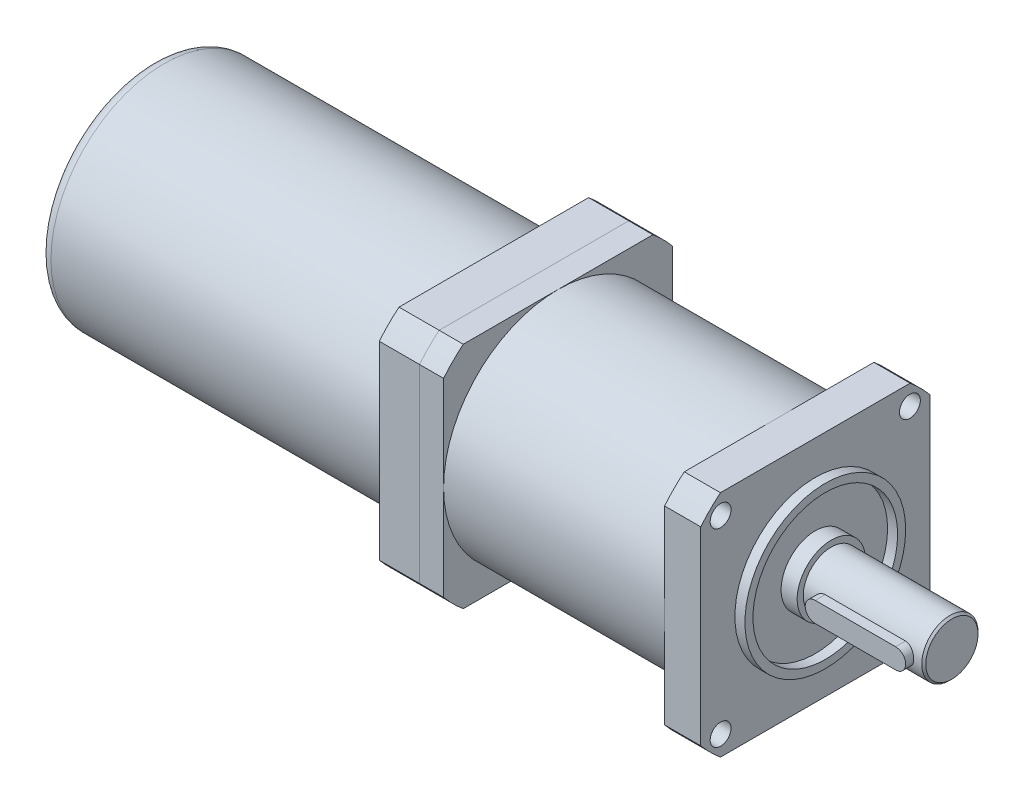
ISO-10303-21;
HEADER;
FILE_DESCRIPTION(('STEP AP214'),'2;1');
FILE_NAME('part.step','',(''),(''),'','','');
FILE_SCHEMA(('AUTOMOTIVE_DESIGN { 1 0 10303 214 1 1 1 1 }'));
ENDSEC;
DATA;
#1=APPLICATION_CONTEXT('core data for automotive mechanical design processes');
#2=APPLICATION_PROTOCOL_DEFINITION('international standard','automotive_design',2000,#1);
#3=PRODUCT_CONTEXT('',#1,'mechanical');
#4=PRODUCT('Part','Part','',(#3));
#5=PRODUCT_RELATED_PRODUCT_CATEGORY('part','',(#4));
#6=PRODUCT_DEFINITION_FORMATION('','',#4);
#7=PRODUCT_DEFINITION_CONTEXT('part definition',#1,'design');
#8=PRODUCT_DEFINITION('design','',#6,#7);
#9=PRODUCT_DEFINITION_SHAPE('','',#8);
#10=(LENGTH_UNIT() NAMED_UNIT(*) SI_UNIT(.MILLI.,.METRE.));
#11=(NAMED_UNIT(*) PLANE_ANGLE_UNIT() SI_UNIT($,.RADIAN.));
#12=(NAMED_UNIT(*) SI_UNIT($,.STERADIAN.) SOLID_ANGLE_UNIT());
#13=UNCERTAINTY_MEASURE_WITH_UNIT(LENGTH_MEASURE(1.E-05),#10,'distance_accuracy_value','');
#14=(GEOMETRIC_REPRESENTATION_CONTEXT(3) GLOBAL_UNCERTAINTY_ASSIGNED_CONTEXT((#13)) GLOBAL_UNIT_ASSIGNED_CONTEXT((#10,
#11,#12)) REPRESENTATION_CONTEXT('',''));
#15=CARTESIAN_POINT('',(0.,0.,0.));
#16=DIRECTION('',(0.,0.,1.));
#17=DIRECTION('',(1.,0.,0.));
#18=AXIS2_PLACEMENT_3D('',#15,#16,#17);
#19=CARTESIAN_POINT('',(-80.,0.,0.));
#20=DIRECTION('',(-1.,0.,0.));
#21=DIRECTION('',(0.,0.,1.));
#22=AXIS2_PLACEMENT_3D('',#19,#20,#21);
#23=PLANE('',#22);
#24=CARTESIAN_POINT('',(-80.,0.,0.));
#25=DIRECTION('',(-1.,0.,0.));
#26=DIRECTION('',(0.,0.,1.));
#27=AXIS2_PLACEMENT_3D('',#24,#25,#26);
#28=CIRCLE('',#27,37.);
#29=CARTESIAN_POINT('',(-80.,28.5,-23.5955504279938));
#30=VERTEX_POINT('',#29);
#31=CARTESIAN_POINT('',(-80.,23.5955504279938,-28.5));
#32=VERTEX_POINT('',#31);
#33=EDGE_CURVE('E158',#30,#32,#28,.T.);
#34=ORIENTED_EDGE('',*,*,#33,.T.);
#35=DIRECTION('',(0.,-1.,0.));
#36=VECTOR('',#35,1.);
#37=CARTESIAN_POINT('',(-80.,-23.5955504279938,-28.5));
#38=LINE('',#37,#36);
#39=CARTESIAN_POINT('',(-80.,-23.5955504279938,-28.5));
#40=VERTEX_POINT('',#39);
#41=EDGE_CURVE('E106',#32,#40,#38,.T.);
#42=ORIENTED_EDGE('',*,*,#41,.T.);
#43=CARTESIAN_POINT('',(-80.,0.,0.));
#44=DIRECTION('',(-1.,0.,0.));
#45=DIRECTION('',(0.,0.,1.));
#46=AXIS2_PLACEMENT_3D('',#43,#44,#45);
#47=CIRCLE('',#46,37.);
#48=CARTESIAN_POINT('',(-80.,-28.5,-23.5955504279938));
#49=VERTEX_POINT('',#48);
#50=EDGE_CURVE('E226',#40,#49,#47,.T.);
#51=ORIENTED_EDGE('',*,*,#50,.T.);
#52=DIRECTION('',(0.,0.,1.));
#53=VECTOR('',#52,1.);
#54=CARTESIAN_POINT('',(-80.,-28.5,-23.5955504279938));
#55=LINE('',#54,#53);
#56=CARTESIAN_POINT('',(-80.,-28.5,23.5955504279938));
#57=VERTEX_POINT('',#56);
#58=EDGE_CURVE('E231',#49,#57,#55,.T.);
#59=ORIENTED_EDGE('',*,*,#58,.T.);
#60=CARTESIAN_POINT('',(-80.,0.,0.));
#61=DIRECTION('',(-1.,0.,0.));
#62=DIRECTION('',(0.,0.,1.));
#63=AXIS2_PLACEMENT_3D('',#60,#61,#62);
#64=CIRCLE('',#63,37.);
#65=CARTESIAN_POINT('',(-80.,-23.5955504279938,28.5));
#66=VERTEX_POINT('',#65);
#67=EDGE_CURVE('E125',#57,#66,#64,.T.);
#68=ORIENTED_EDGE('',*,*,#67,.T.);
#69=DIRECTION('',(0.,1.,0.));
#70=VECTOR('',#69,1.);
#71=CARTESIAN_POINT('',(-80.,-23.5955504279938,28.5));
#72=LINE('',#71,#70);
#73=CARTESIAN_POINT('',(-80.,23.5955504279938,28.5));
#74=VERTEX_POINT('',#73);
#75=EDGE_CURVE('E119',#66,#74,#72,.T.);
#76=ORIENTED_EDGE('',*,*,#75,.T.);
#77=CARTESIAN_POINT('',(-80.,0.,0.));
#78=DIRECTION('',(-1.,0.,0.));
#79=DIRECTION('',(0.,0.,1.));
#80=AXIS2_PLACEMENT_3D('',#77,#78,#79);
#81=CIRCLE('',#80,37.);
#82=CARTESIAN_POINT('',(-80.,28.5,23.5955504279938));
#83=VERTEX_POINT('',#82);
#84=EDGE_CURVE('E123',#74,#83,#81,.T.);
#85=ORIENTED_EDGE('',*,*,#84,.T.);
#86=DIRECTION('',(0.,0.,-1.));
#87=VECTOR('',#86,1.);
#88=CARTESIAN_POINT('',(-80.,28.5,-23.5955504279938));
#89=LINE('',#88,#87);
#90=EDGE_CURVE('E62',#83,#30,#89,.T.);
#91=ORIENTED_EDGE('',*,*,#90,.T.);
#92=EDGE_LOOP('',(#34,#42,#51,#59,#68,#76,#85,#91));
#93=FACE_BOUND('',#92,.T.);
#94=CARTESIAN_POINT('',(-80.,0.,0.));
#95=DIRECTION('',(-1.,0.,0.));
#96=DIRECTION('',(0.,0.,1.));
#97=AXIS2_PLACEMENT_3D('',#94,#95,#96);
#98=CIRCLE('',#97,28.2);
#99=CARTESIAN_POINT('',(-80.,0.,28.2));
#100=VERTEX_POINT('',#99);
#101=EDGE_CURVE('E147',#100,#100,#98,.T.);
#102=ORIENTED_EDGE('',*,*,#101,.F.);
#103=EDGE_LOOP('',(#102));
#104=FACE_BOUND('',#103,.T.);
#105=ADVANCED_FACE('F45',(#93,#104),#23,.T.);
#106=CARTESIAN_POINT('',(-80.,0.,0.));
#107=DIRECTION('',(1.,0.,0.));
#108=DIRECTION('',(0.,0.,-1.));
#109=AXIS2_PLACEMENT_3D('',#106,#107,#108);
#110=CYLINDRICAL_SURFACE('',#109,37.);
#111=CARTESIAN_POINT('',(-70.,0.,0.));
#112=DIRECTION('',(-1.,0.,0.));
#113=DIRECTION('',(0.,0.,1.));
#114=AXIS2_PLACEMENT_3D('',#111,#112,#113);
#115=CIRCLE('',#114,37.);
#116=CARTESIAN_POINT('',(-70.,28.5,-23.5955504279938));
#117=VERTEX_POINT('',#116);
#118=CARTESIAN_POINT('',(-70.,23.5955504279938,-28.5));
#119=VERTEX_POINT('',#118);
#120=EDGE_CURVE('E143',#117,#119,#115,.T.);
#121=ORIENTED_EDGE('',*,*,#120,.T.);
#122=DIRECTION('',(1.,0.,0.));
#123=VECTOR('',#122,1.);
#124=CARTESIAN_POINT('',(-80.,23.5955504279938,-28.5));
#125=LINE('',#124,#123);
#126=EDGE_CURVE('E171',#32,#119,#125,.T.);
#127=ORIENTED_EDGE('',*,*,#126,.F.);
#128=ORIENTED_EDGE('',*,*,#33,.F.);
#129=DIRECTION('',(1.,0.,0.));
#130=VECTOR('',#129,1.);
#131=CARTESIAN_POINT('',(-80.,28.5,-23.5955504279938));
#132=LINE('',#131,#130);
#133=EDGE_CURVE('E139',#30,#117,#132,.T.);
#134=ORIENTED_EDGE('',*,*,#133,.T.);
#135=EDGE_LOOP('',(#121,#127,#128,#134));
#136=FACE_BOUND('',#135,.T.);
#137=ADVANCED_FACE('F186',(#136),#110,.T.);
#138=CARTESIAN_POINT('',(-80.,-23.5955504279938,-28.5));
#139=DIRECTION('',(0.,0.,1.));
#140=DIRECTION('',(1.,0.,0.));
#141=AXIS2_PLACEMENT_3D('',#138,#139,#140);
#142=PLANE('',#141);
#143=DIRECTION('',(0.,-1.,0.));
#144=VECTOR('',#143,1.);
#145=CARTESIAN_POINT('',(-70.,-23.5955504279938,-28.5));
#146=LINE('',#145,#144);
#147=CARTESIAN_POINT('',(-70.,-23.5955504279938,-28.5));
#148=VERTEX_POINT('',#147);
#149=EDGE_CURVE('E146',#119,#148,#146,.T.);
#150=ORIENTED_EDGE('',*,*,#149,.T.);
#151=DIRECTION('',(1.,0.,0.));
#152=VECTOR('',#151,1.);
#153=CARTESIAN_POINT('',(-80.,-23.5955504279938,-28.5));
#154=LINE('',#153,#152);
#155=EDGE_CURVE('E168',#40,#148,#154,.T.);
#156=ORIENTED_EDGE('',*,*,#155,.F.);
#157=ORIENTED_EDGE('',*,*,#41,.F.);
#158=ORIENTED_EDGE('',*,*,#126,.T.);
#159=EDGE_LOOP('',(#150,#156,#157,#158));
#160=FACE_BOUND('',#159,.T.);
#161=ADVANCED_FACE('F191',(#160),#142,.F.);
#162=CARTESIAN_POINT('',(-80.,0.,0.));
#163=DIRECTION('',(1.,0.,0.));
#164=DIRECTION('',(0.,0.,-1.));
#165=AXIS2_PLACEMENT_3D('',#162,#163,#164);
#166=CYLINDRICAL_SURFACE('',#165,37.);
#167=CARTESIAN_POINT('',(-70.,0.,0.));
#168=DIRECTION('',(-1.,0.,0.));
#169=DIRECTION('',(0.,0.,1.));
#170=AXIS2_PLACEMENT_3D('',#167,#168,#169);
#171=CIRCLE('',#170,37.);
#172=CARTESIAN_POINT('',(-70.,-28.5,-23.5955504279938));
#173=VERTEX_POINT('',#172);
#174=EDGE_CURVE('E149',#148,#173,#171,.T.);
#175=ORIENTED_EDGE('',*,*,#174,.T.);
#176=DIRECTION('',(1.,0.,0.));
#177=VECTOR('',#176,1.);
#178=CARTESIAN_POINT('',(-80.,-28.5,-23.5955504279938));
#179=LINE('',#178,#177);
#180=EDGE_CURVE('E165',#49,#173,#179,.T.);
#181=ORIENTED_EDGE('',*,*,#180,.F.);
#182=ORIENTED_EDGE('',*,*,#50,.F.);
#183=ORIENTED_EDGE('',*,*,#155,.T.);
#184=EDGE_LOOP('',(#175,#181,#182,#183));
#185=FACE_BOUND('',#184,.T.);
#186=ADVANCED_FACE('F213',(#185),#166,.T.);
#187=CARTESIAN_POINT('',(-80.,-28.5,-23.5955504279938));
#188=DIRECTION('',(0.,1.,0.));
#189=DIRECTION('',(0.,0.,1.));
#190=AXIS2_PLACEMENT_3D('',#187,#188,#189);
#191=PLANE('',#190);
#192=DIRECTION('',(0.,0.,1.));
#193=VECTOR('',#192,1.);
#194=CARTESIAN_POINT('',(-70.,-28.5,-23.5955504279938));
#195=LINE('',#194,#193);
#196=CARTESIAN_POINT('',(-70.,-28.5,23.5955504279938));
#197=VERTEX_POINT('',#196);
#198=EDGE_CURVE('E151',#173,#197,#195,.T.);
#199=ORIENTED_EDGE('',*,*,#198,.T.);
#200=DIRECTION('',(1.,0.,0.));
#201=VECTOR('',#200,1.);
#202=CARTESIAN_POINT('',(-80.,-28.5,23.5955504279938));
#203=LINE('',#202,#201);
#204=EDGE_CURVE('E162',#57,#197,#203,.T.);
#205=ORIENTED_EDGE('',*,*,#204,.F.);
#206=ORIENTED_EDGE('',*,*,#58,.F.);
#207=ORIENTED_EDGE('',*,*,#180,.T.);
#208=EDGE_LOOP('',(#199,#205,#206,#207));
#209=FACE_BOUND('',#208,.T.);
#210=ADVANCED_FACE('F209',(#209),#191,.F.);
#211=CARTESIAN_POINT('',(-80.,0.,0.));
#212=DIRECTION('',(1.,0.,0.));
#213=DIRECTION('',(0.,0.,-1.));
#214=AXIS2_PLACEMENT_3D('',#211,#212,#213);
#215=CYLINDRICAL_SURFACE('',#214,37.);
#216=CARTESIAN_POINT('',(-70.,0.,0.));
#217=DIRECTION('',(-1.,0.,0.));
#218=DIRECTION('',(0.,0.,1.));
#219=AXIS2_PLACEMENT_3D('',#216,#217,#218);
#220=CIRCLE('',#219,37.);
#221=CARTESIAN_POINT('',(-70.,-23.5955504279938,28.5));
#222=VERTEX_POINT('',#221);
#223=EDGE_CURVE('E153',#197,#222,#220,.T.);
#224=ORIENTED_EDGE('',*,*,#223,.T.);
#225=DIRECTION('',(1.,0.,0.));
#226=VECTOR('',#225,1.);
#227=CARTESIAN_POINT('',(-80.,-23.5955504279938,28.5));
#228=LINE('',#227,#226);
#229=EDGE_CURVE('E134',#66,#222,#228,.T.);
#230=ORIENTED_EDGE('',*,*,#229,.F.);
#231=ORIENTED_EDGE('',*,*,#67,.F.);
#232=ORIENTED_EDGE('',*,*,#204,.T.);
#233=EDGE_LOOP('',(#224,#230,#231,#232));
#234=FACE_BOUND('',#233,.T.);
#235=ADVANCED_FACE('F206',(#234),#215,.T.);
#236=CARTESIAN_POINT('',(-80.,-23.5955504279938,28.5));
#237=DIRECTION('',(0.,0.,-1.));
#238=DIRECTION('',(-1.,0.,0.));
#239=AXIS2_PLACEMENT_3D('',#236,#237,#238);
#240=PLANE('',#239);
#241=DIRECTION('',(0.,1.,0.));
#242=VECTOR('',#241,1.);
#243=CARTESIAN_POINT('',(-70.,-23.5955504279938,28.5));
#244=LINE('',#243,#242);
#245=CARTESIAN_POINT('',(-70.,23.5955504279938,28.5));
#246=VERTEX_POINT('',#245);
#247=EDGE_CURVE('E133',#222,#246,#244,.T.);
#248=ORIENTED_EDGE('',*,*,#247,.T.);
#249=DIRECTION('',(1.,0.,0.));
#250=VECTOR('',#249,1.);
#251=CARTESIAN_POINT('',(-80.,23.5955504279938,28.5));
#252=LINE('',#251,#250);
#253=EDGE_CURVE('E130',#74,#246,#252,.T.);
#254=ORIENTED_EDGE('',*,*,#253,.F.);
#255=ORIENTED_EDGE('',*,*,#75,.F.);
#256=ORIENTED_EDGE('',*,*,#229,.T.);
#257=EDGE_LOOP('',(#248,#254,#255,#256));
#258=FACE_BOUND('',#257,.T.);
#259=ADVANCED_FACE('F131',(#258),#240,.F.);
#260=CARTESIAN_POINT('',(-80.,0.,0.));
#261=DIRECTION('',(1.,0.,0.));
#262=DIRECTION('',(0.,0.,-1.));
#263=AXIS2_PLACEMENT_3D('',#260,#261,#262);
#264=CYLINDRICAL_SURFACE('',#263,37.);
#265=CARTESIAN_POINT('',(-70.,0.,0.));
#266=DIRECTION('',(-1.,0.,0.));
#267=DIRECTION('',(0.,0.,1.));
#268=AXIS2_PLACEMENT_3D('',#265,#266,#267);
#269=CIRCLE('',#268,37.);
#270=CARTESIAN_POINT('',(-70.,28.5,23.5955504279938));
#271=VERTEX_POINT('',#270);
#272=EDGE_CURVE('E91',#246,#271,#269,.T.);
#273=ORIENTED_EDGE('',*,*,#272,.T.);
#274=DIRECTION('',(1.,0.,0.));
#275=VECTOR('',#274,1.);
#276=CARTESIAN_POINT('',(-80.,28.5,23.5955504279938));
#277=LINE('',#276,#275);
#278=EDGE_CURVE('E135',#83,#271,#277,.T.);
#279=ORIENTED_EDGE('',*,*,#278,.F.);
#280=ORIENTED_EDGE('',*,*,#84,.F.);
#281=ORIENTED_EDGE('',*,*,#253,.T.);
#282=EDGE_LOOP('',(#273,#279,#280,#281));
#283=FACE_BOUND('',#282,.T.);
#284=ADVANCED_FACE('F137',(#283),#264,.T.);
#285=CARTESIAN_POINT('',(-80.,28.5,-23.5955504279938));
#286=DIRECTION('',(0.,-1.,0.));
#287=DIRECTION('',(0.,0.,-1.));
#288=AXIS2_PLACEMENT_3D('',#285,#286,#287);
#289=PLANE('',#288);
#290=DIRECTION('',(0.,0.,-1.));
#291=VECTOR('',#290,1.);
#292=CARTESIAN_POINT('',(-70.,28.5,-23.5955504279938));
#293=LINE('',#292,#291);
#294=EDGE_CURVE('E97',#271,#117,#293,.T.);
#295=ORIENTED_EDGE('',*,*,#294,.T.);
#296=ORIENTED_EDGE('',*,*,#133,.F.);
#297=ORIENTED_EDGE('',*,*,#90,.F.);
#298=ORIENTED_EDGE('',*,*,#278,.T.);
#299=EDGE_LOOP('',(#295,#296,#297,#298));
#300=FACE_BOUND('',#299,.T.);
#301=ADVANCED_FACE('F198',(#300),#289,.F.);
#302=CARTESIAN_POINT('',(-70.,0.,0.));
#303=DIRECTION('',(-1.,0.,0.));
#304=DIRECTION('',(0.,0.,1.));
#305=AXIS2_PLACEMENT_3D('',#302,#303,#304);
#306=PLANE('',#305);
#307=ORIENTED_EDGE('',*,*,#120,.F.);
#308=ORIENTED_EDGE('',*,*,#294,.F.);
#309=ORIENTED_EDGE('',*,*,#272,.F.);
#310=ORIENTED_EDGE('',*,*,#247,.F.);
#311=ORIENTED_EDGE('',*,*,#223,.F.);
#312=ORIENTED_EDGE('',*,*,#198,.F.);
#313=ORIENTED_EDGE('',*,*,#174,.F.);
#314=ORIENTED_EDGE('',*,*,#149,.F.);
#315=EDGE_LOOP('',(#307,#308,#309,#310,#311,#312,#313,#314));
#316=FACE_BOUND('',#315,.T.);
#317=ADVANCED_FACE('F195',(#316),#306,.F.);
#318=CARTESIAN_POINT('',(-165.,0.,0.));
#319=DIRECTION('',(1.,0.,0.));
#320=DIRECTION('',(0.,0.,-1.));
#321=AXIS2_PLACEMENT_3D('',#318,#319,#320);
#322=CYLINDRICAL_SURFACE('',#321,28.2);
#323=CARTESIAN_POINT('',(-162.,0.,0.));
#324=DIRECTION('',(-1.,0.,0.));
#325=DIRECTION('',(0.,0.,1.));
#326=AXIS2_PLACEMENT_3D('',#323,#324,#325);
#327=CIRCLE('',#326,28.2);
#328=CARTESIAN_POINT('',(-162.,0.,28.2));
#329=VERTEX_POINT('',#328);
#330=EDGE_CURVE('E12',#329,#329,#327,.F.);
#331=ORIENTED_EDGE('',*,*,#330,.T.);
#332=EDGE_LOOP('',(#331));
#333=FACE_BOUND('',#332,.T.);
#334=ORIENTED_EDGE('',*,*,#101,.T.);
#335=EDGE_LOOP('',(#334));
#336=FACE_BOUND('',#335,.T.);
#337=ADVANCED_FACE('F182',(#333,#336),#322,.T.);
#338=CARTESIAN_POINT('',(-165.,0.,0.));
#339=DIRECTION('',(-1.,0.,0.));
#340=DIRECTION('',(0.,0.,1.));
#341=AXIS2_PLACEMENT_3D('',#338,#339,#340);
#342=PLANE('',#341);
#343=CARTESIAN_POINT('',(-165.,0.,0.));
#344=DIRECTION('',(-1.,0.,0.));
#345=DIRECTION('',(0.,0.,1.));
#346=AXIS2_PLACEMENT_3D('',#343,#344,#345);
#347=CIRCLE('',#346,25.2);
#348=CARTESIAN_POINT('',(-165.,0.,25.2));
#349=VERTEX_POINT('',#348);
#350=EDGE_CURVE('E54',#349,#349,#347,.T.);
#351=ORIENTED_EDGE('',*,*,#350,.T.);
#352=EDGE_LOOP('',(#351));
#353=FACE_BOUND('',#352,.T.);
#354=ADVANCED_FACE('F175',(#353),#342,.T.);
#355=CARTESIAN_POINT('',(-162.,0.,0.));
#356=DIRECTION('',(-1.,0.,0.));
#357=DIRECTION('',(0.,0.,1.));
#358=AXIS2_PLACEMENT_3D('',#355,#356,#357);
#359=TOROIDAL_SURFACE('',#358,25.2,3.);
#360=ORIENTED_EDGE('',*,*,#330,.F.);
#361=EDGE_LOOP('',(#360));
#362=FACE_BOUND('',#361,.T.);
#363=ORIENTED_EDGE('',*,*,#350,.F.);
#364=EDGE_LOOP('',(#363));
#365=FACE_BOUND('',#364,.T.);
#366=ADVANCED_FACE('F47',(#362,#365),#359,.T.);
#367=CLOSED_SHELL('',(#105,#137,#161,#186,#210,#235,#259,#284,#301,#317,#337,#354,#366));
#368=MANIFOLD_SOLID_BREP('B2',#367);
#369=CARTESIAN_POINT('',(4.,0.,0.));
#370=DIRECTION('',(1.,0.,0.));
#371=DIRECTION('',(0.,0.,-1.));
#372=AXIS2_PLACEMENT_3D('',#369,#370,#371);
#373=PLANE('',#372);
#374=CARTESIAN_POINT('',(4.,0.,0.));
#375=DIRECTION('',(1.,0.,0.));
#376=DIRECTION('',(0.,0.,-1.));
#377=AXIS2_PLACEMENT_3D('',#374,#375,#376);
#378=CIRCLE('',#377,8.5);
#379=CARTESIAN_POINT('',(4.,0.,-8.5));
#380=VERTEX_POINT('',#379);
#381=EDGE_CURVE('E510',#380,#380,#378,.T.);
#382=ORIENTED_EDGE('',*,*,#381,.T.);
#383=EDGE_LOOP('',(#382));
#384=FACE_BOUND('',#383,.T.);
#385=CARTESIAN_POINT('',(4.,0.,0.));
#386=DIRECTION('',(1.,0.,0.));
#387=DIRECTION('',(0.,0.,-1.));
#388=AXIS2_PLACEMENT_3D('',#385,#386,#387);
#389=CIRCLE('',#388,7.);
#390=CARTESIAN_POINT('',(4.,0.,-7.));
#391=VERTEX_POINT('',#390);
#392=EDGE_CURVE('E501',#391,#391,#389,.T.);
#393=ORIENTED_EDGE('',*,*,#392,.F.);
#394=EDGE_LOOP('',(#393));
#395=FACE_BOUND('',#394,.T.);
#396=ADVANCED_FACE('F318',(#384,#395),#373,.T.);
#397=CARTESIAN_POINT('',(0.,0.,0.));
#398=DIRECTION('',(1.,0.,0.));
#399=DIRECTION('',(0.,0.,-1.));
#400=AXIS2_PLACEMENT_3D('',#397,#398,#399);
#401=PLANE('',#400);
#402=CARTESIAN_POINT('',(0.,0.,0.));
#403=DIRECTION('',(1.,0.,0.));
#404=DIRECTION('',(0.,0.,-1.));
#405=AXIS2_PLACEMENT_3D('',#402,#403,#404);
#406=CIRCLE('',#405,18.);
#407=CARTESIAN_POINT('',(0.,0.,-18.));
#408=VERTEX_POINT('',#407);
#409=EDGE_CURVE('E690',#408,#408,#406,.F.);
#410=ORIENTED_EDGE('',*,*,#409,.F.);
#411=EDGE_LOOP('',(#410));
#412=FACE_BOUND('',#411,.T.);
#413=CARTESIAN_POINT('',(0.,0.,0.));
#414=DIRECTION('',(1.,0.,0.));
#415=DIRECTION('',(0.,0.,-1.));
#416=AXIS2_PLACEMENT_3D('',#413,#414,#415);
#417=CIRCLE('',#416,8.5);
#418=CARTESIAN_POINT('',(0.,0.,-8.5));
#419=VERTEX_POINT('',#418);
#420=EDGE_CURVE('E504',#419,#419,#417,.T.);
#421=ORIENTED_EDGE('',*,*,#420,.F.);
#422=EDGE_LOOP('',(#421));
#423=FACE_BOUND('',#422,.T.);
#424=ADVANCED_FACE('F725',(#412,#423),#401,.T.);
#425=CARTESIAN_POINT('',(0.,-23.55,23.55));
#426=DIRECTION('',(1.,0.,0.));
#427=DIRECTION('',(0.,0.,-1.));
#428=AXIS2_PLACEMENT_3D('',#425,#426,#427);
#429=CIRCLE('',#428,2.6);
#430=CARTESIAN_POINT('',(0.,-23.55,20.95));
#431=VERTEX_POINT('',#430);
#432=EDGE_CURVE('E522',#431,#431,#429,.T.);
#433=ORIENTED_EDGE('',*,*,#432,.F.);
#434=EDGE_LOOP('',(#433));
#435=FACE_BOUND('',#434,.T.);
#436=CARTESIAN_POINT('',(0.,-23.55,-23.55));
#437=DIRECTION('',(1.,0.,0.));
#438=DIRECTION('',(0.,0.,-1.));
#439=AXIS2_PLACEMENT_3D('',#436,#437,#438);
#440=CIRCLE('',#439,2.6);
#441=CARTESIAN_POINT('',(0.,-23.55,-26.15));
#442=VERTEX_POINT('',#441);
#443=EDGE_CURVE('E528',#442,#442,#440,.T.);
#444=ORIENTED_EDGE('',*,*,#443,.F.);
#445=EDGE_LOOP('',(#444));
#446=FACE_BOUND('',#445,.T.);
#447=CARTESIAN_POINT('',(0.,23.55,-23.55));
#448=DIRECTION('',(1.,0.,0.));
#449=DIRECTION('',(0.,0.,-1.));
#450=AXIS2_PLACEMENT_3D('',#447,#448,#449);
#451=CIRCLE('',#450,2.6);
#452=CARTESIAN_POINT('',(0.,23.55,-26.15));
#453=VERTEX_POINT('',#452);
#454=EDGE_CURVE('E534',#453,#453,#451,.T.);
#455=ORIENTED_EDGE('',*,*,#454,.F.);
#456=EDGE_LOOP('',(#455));
#457=FACE_BOUND('',#456,.T.);
#458=CARTESIAN_POINT('',(0.,23.55,23.55));
#459=DIRECTION('',(1.,0.,0.));
#460=DIRECTION('',(0.,0.,-1.));
#461=AXIS2_PLACEMENT_3D('',#458,#459,#460);
#462=CIRCLE('',#461,2.6);
#463=CARTESIAN_POINT('',(0.,23.55,20.95));
#464=VERTEX_POINT('',#463);
#465=EDGE_CURVE('E540',#464,#464,#462,.T.);
#466=ORIENTED_EDGE('',*,*,#465,.F.);
#467=EDGE_LOOP('',(#466));
#468=FACE_BOUND('',#467,.T.);
#469=CARTESIAN_POINT('',(0.,0.,0.));
#470=DIRECTION('',(1.,0.,0.));
#471=DIRECTION('',(0.,0.,-1.));
#472=AXIS2_PLACEMENT_3D('',#469,#470,#471);
#473=CIRCLE('',#472,37.);
#474=CARTESIAN_POINT('',(0.,23.5955504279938,-28.5));
#475=VERTEX_POINT('',#474);
#476=CARTESIAN_POINT('',(0.,28.5,-23.5955504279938));
#477=VERTEX_POINT('',#476);
#478=EDGE_CURVE('E618',#475,#477,#473,.T.);
#479=ORIENTED_EDGE('',*,*,#478,.T.);
#480=DIRECTION('',(0.,0.,1.));
#481=VECTOR('',#480,1.);
#482=CARTESIAN_POINT('',(0.,28.5,23.5955504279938));
#483=LINE('',#482,#481);
#484=CARTESIAN_POINT('',(0.,28.5,23.5955504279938));
#485=VERTEX_POINT('',#484);
#486=EDGE_CURVE('E655',#477,#485,#483,.T.);
#487=ORIENTED_EDGE('',*,*,#486,.T.);
#488=CARTESIAN_POINT('',(0.,0.,0.));
#489=DIRECTION('',(1.,0.,0.));
#490=DIRECTION('',(0.,0.,-1.));
#491=AXIS2_PLACEMENT_3D('',#488,#489,#490);
#492=CIRCLE('',#491,37.);
#493=CARTESIAN_POINT('',(0.,23.5955504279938,28.5));
#494=VERTEX_POINT('',#493);
#495=EDGE_CURVE('E658',#485,#494,#492,.T.);
#496=ORIENTED_EDGE('',*,*,#495,.T.);
#497=DIRECTION('',(0.,-1.,0.));
#498=VECTOR('',#497,1.);
#499=CARTESIAN_POINT('',(0.,-23.5955504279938,28.5));
#500=LINE('',#499,#498);
#501=CARTESIAN_POINT('',(0.,-23.5955504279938,28.5));
#502=VERTEX_POINT('',#501);
#503=EDGE_CURVE('E661',#494,#502,#500,.T.);
#504=ORIENTED_EDGE('',*,*,#503,.T.);
#505=CARTESIAN_POINT('',(0.,0.,0.));
#506=DIRECTION('',(1.,0.,0.));
#507=DIRECTION('',(0.,0.,-1.));
#508=AXIS2_PLACEMENT_3D('',#505,#506,#507);
#509=CIRCLE('',#508,37.);
#510=CARTESIAN_POINT('',(0.,-28.5,23.5955504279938));
#511=VERTEX_POINT('',#510);
#512=EDGE_CURVE('E664',#502,#511,#509,.T.);
#513=ORIENTED_EDGE('',*,*,#512,.T.);
#514=DIRECTION('',(0.,0.,-1.));
#515=VECTOR('',#514,1.);
#516=CARTESIAN_POINT('',(0.,-28.5,23.5955504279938));
#517=LINE('',#516,#515);
#518=CARTESIAN_POINT('',(0.,-28.5,-23.5955504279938));
#519=VERTEX_POINT('',#518);
#520=EDGE_CURVE('E667',#511,#519,#517,.T.);
#521=ORIENTED_EDGE('',*,*,#520,.T.);
#522=CARTESIAN_POINT('',(0.,0.,0.));
#523=DIRECTION('',(1.,0.,0.));
#524=DIRECTION('',(0.,0.,-1.));
#525=AXIS2_PLACEMENT_3D('',#522,#523,#524);
#526=CIRCLE('',#525,37.);
#527=CARTESIAN_POINT('',(0.,-23.5955504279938,-28.5));
#528=VERTEX_POINT('',#527);
#529=EDGE_CURVE('E670',#519,#528,#526,.T.);
#530=ORIENTED_EDGE('',*,*,#529,.T.);
#531=DIRECTION('',(0.,1.,0.));
#532=VECTOR('',#531,1.);
#533=CARTESIAN_POINT('',(0.,-23.5955504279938,-28.5));
#534=LINE('',#533,#532);
#535=EDGE_CURVE('E628',#528,#475,#534,.T.);
#536=ORIENTED_EDGE('',*,*,#535,.T.);
#537=EDGE_LOOP('',(#479,#487,#496,#504,#513,#521,#530,#536));
#538=FACE_BOUND('',#537,.T.);
#539=CARTESIAN_POINT('',(0.,0.,0.));
#540=DIRECTION('',(1.,0.,0.));
#541=DIRECTION('',(0.,0.,-1.));
#542=AXIS2_PLACEMENT_3D('',#539,#540,#541);
#543=CIRCLE('',#542,20.);
#544=CARTESIAN_POINT('',(0.,0.,-20.));
#545=VERTEX_POINT('',#544);
#546=EDGE_CURVE('E518',#545,#545,#543,.T.);
#547=ORIENTED_EDGE('',*,*,#546,.F.);
#548=EDGE_LOOP('',(#547));
#549=FACE_BOUND('',#548,.T.);
#550=ADVANCED_FACE('F730',(#435,#446,#457,#468,#538,#549),#401,.T.);
#551=CARTESIAN_POINT('',(-9.,0.,0.));
#552=DIRECTION('',(1.,0.,0.));
#553=DIRECTION('',(0.,0.,-1.));
#554=AXIS2_PLACEMENT_3D('',#551,#552,#553);
#555=PLANE('',#554);
#556=CARTESIAN_POINT('',(-9.,23.55,23.55));
#557=DIRECTION('',(1.,0.,0.));
#558=DIRECTION('',(0.,0.,-1.));
#559=AXIS2_PLACEMENT_3D('',#556,#557,#558);
#560=CIRCLE('',#559,2.6);
#561=CARTESIAN_POINT('',(-9.,23.55,20.95));
#562=VERTEX_POINT('',#561);
#563=EDGE_CURVE('E543',#562,#562,#560,.T.);
#564=ORIENTED_EDGE('',*,*,#563,.T.);
#565=EDGE_LOOP('',(#564));
#566=FACE_BOUND('',#565,.T.);
#567=CARTESIAN_POINT('',(-9.,0.,0.));
#568=DIRECTION('',(-1.,0.,0.));
#569=DIRECTION('',(0.,0.,1.));
#570=AXIS2_PLACEMENT_3D('',#567,#568,#569);
#571=CIRCLE('',#570,28.5);
#572=CARTESIAN_POINT('',(-9.,0.,28.5));
#573=VERTEX_POINT('',#572);
#574=CARTESIAN_POINT('',(-9.,28.5,0.));
#575=VERTEX_POINT('',#574);
#576=EDGE_CURVE('E614',#573,#575,#571,.T.);
#577=ORIENTED_EDGE('',*,*,#576,.F.);
#578=DIRECTION('',(0.,-1.,0.));
#579=VECTOR('',#578,1.);
#580=CARTESIAN_POINT('',(-9.,-23.5955504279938,28.5));
#581=LINE('',#580,#579);
#582=CARTESIAN_POINT('',(-9.,23.5955504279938,28.5));
#583=VERTEX_POINT('',#582);
#584=EDGE_CURVE('E636',#583,#573,#581,.T.);
#585=ORIENTED_EDGE('',*,*,#584,.F.);
#586=CARTESIAN_POINT('',(-9.,0.,0.));
#587=DIRECTION('',(1.,0.,0.));
#588=DIRECTION('',(0.,0.,-1.));
#589=AXIS2_PLACEMENT_3D('',#586,#587,#588);
#590=CIRCLE('',#589,37.);
#591=CARTESIAN_POINT('',(-9.,28.5,23.5955504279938));
#592=VERTEX_POINT('',#591);
#593=EDGE_CURVE('E632',#592,#583,#590,.T.);
#594=ORIENTED_EDGE('',*,*,#593,.F.);
#595=DIRECTION('',(0.,0.,1.));
#596=VECTOR('',#595,1.);
#597=CARTESIAN_POINT('',(-9.,28.5,23.5955504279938));
#598=LINE('',#597,#596);
#599=EDGE_CURVE('E627',#575,#592,#598,.T.);
#600=ORIENTED_EDGE('',*,*,#599,.F.);
#601=EDGE_LOOP('',(#577,#585,#594,#600));
#602=FACE_BOUND('',#601,.T.);
#603=ADVANCED_FACE('F812',(#566,#602),#555,.F.);
#604=CARTESIAN_POINT('',(-9.,23.55,-23.55));
#605=DIRECTION('',(1.,0.,0.));
#606=DIRECTION('',(0.,0.,-1.));
#607=AXIS2_PLACEMENT_3D('',#604,#605,#606);
#608=CIRCLE('',#607,2.6);
#609=CARTESIAN_POINT('',(-9.,23.55,-26.15));
#610=VERTEX_POINT('',#609);
#611=EDGE_CURVE('E537',#610,#610,#608,.T.);
#612=ORIENTED_EDGE('',*,*,#611,.T.);
#613=EDGE_LOOP('',(#612));
#614=FACE_BOUND('',#613,.T.);
#615=CARTESIAN_POINT('',(-9.,0.,-28.5));
#616=VERTEX_POINT('',#615);
#617=EDGE_CURVE('E622',#575,#616,#571,.T.);
#618=ORIENTED_EDGE('',*,*,#617,.F.);
#619=CARTESIAN_POINT('',(-9.,28.5,-23.5955504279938));
#620=VERTEX_POINT('',#619);
#621=EDGE_CURVE('E629',#620,#575,#598,.T.);
#622=ORIENTED_EDGE('',*,*,#621,.F.);
#623=CARTESIAN_POINT('',(-9.,0.,0.));
#624=DIRECTION('',(1.,0.,0.));
#625=DIRECTION('',(0.,0.,-1.));
#626=AXIS2_PLACEMENT_3D('',#623,#624,#625);
#627=CIRCLE('',#626,37.);
#628=CARTESIAN_POINT('',(-9.,23.5955504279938,-28.5));
#629=VERTEX_POINT('',#628);
#630=EDGE_CURVE('E624',#629,#620,#627,.T.);
#631=ORIENTED_EDGE('',*,*,#630,.F.);
#632=DIRECTION('',(0.,1.,0.));
#633=VECTOR('',#632,1.);
#634=CARTESIAN_POINT('',(-9.,-23.5955504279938,-28.5));
#635=LINE('',#634,#633);
#636=EDGE_CURVE('E648',#616,#629,#635,.T.);
#637=ORIENTED_EDGE('',*,*,#636,.F.);
#638=EDGE_LOOP('',(#618,#622,#631,#637));
#639=FACE_BOUND('',#638,.T.);
#640=ADVANCED_FACE('F814',(#614,#639),#555,.F.);
#641=CARTESIAN_POINT('',(-9.,-23.55,-23.55));
#642=DIRECTION('',(1.,0.,0.));
#643=DIRECTION('',(0.,0.,-1.));
#644=AXIS2_PLACEMENT_3D('',#641,#642,#643);
#645=CIRCLE('',#644,2.6);
#646=CARTESIAN_POINT('',(-9.,-23.55,-26.15));
#647=VERTEX_POINT('',#646);
#648=EDGE_CURVE('E531',#647,#647,#645,.T.);
#649=ORIENTED_EDGE('',*,*,#648,.T.);
#650=EDGE_LOOP('',(#649));
#651=FACE_BOUND('',#650,.T.);
#652=CARTESIAN_POINT('',(-9.,-28.5,0.));
#653=VERTEX_POINT('',#652);
#654=EDGE_CURVE('E886',#616,#653,#571,.T.);
#655=ORIENTED_EDGE('',*,*,#654,.F.);
#656=CARTESIAN_POINT('',(-9.,-23.5955504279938,-28.5));
#657=VERTEX_POINT('',#656);
#658=EDGE_CURVE('E649',#657,#616,#635,.T.);
#659=ORIENTED_EDGE('',*,*,#658,.F.);
#660=CARTESIAN_POINT('',(-9.,0.,0.));
#661=DIRECTION('',(1.,0.,0.));
#662=DIRECTION('',(0.,0.,-1.));
#663=AXIS2_PLACEMENT_3D('',#660,#661,#662);
#664=CIRCLE('',#663,37.);
#665=CARTESIAN_POINT('',(-9.,-28.5,-23.5955504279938));
#666=VERTEX_POINT('',#665);
#667=EDGE_CURVE('E645',#666,#657,#664,.T.);
#668=ORIENTED_EDGE('',*,*,#667,.F.);
#669=DIRECTION('',(0.,0.,-1.));
#670=VECTOR('',#669,1.);
#671=CARTESIAN_POINT('',(-9.,-28.5,23.5955504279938));
#672=LINE('',#671,#670);
#673=EDGE_CURVE('E641',#653,#666,#672,.T.);
#674=ORIENTED_EDGE('',*,*,#673,.F.);
#675=EDGE_LOOP('',(#655,#659,#668,#674));
#676=FACE_BOUND('',#675,.T.);
#677=ADVANCED_FACE('F850',(#651,#676),#555,.F.);
#678=CARTESIAN_POINT('',(-9.,-23.55,23.55));
#679=DIRECTION('',(1.,0.,0.));
#680=DIRECTION('',(0.,0.,-1.));
#681=AXIS2_PLACEMENT_3D('',#678,#679,#680);
#682=CIRCLE('',#681,2.6);
#683=CARTESIAN_POINT('',(-9.,-23.55,20.95));
#684=VERTEX_POINT('',#683);
#685=EDGE_CURVE('E525',#684,#684,#682,.T.);
#686=ORIENTED_EDGE('',*,*,#685,.T.);
#687=EDGE_LOOP('',(#686));
#688=FACE_BOUND('',#687,.T.);
#689=EDGE_CURVE('E623',#653,#573,#571,.T.);
#690=ORIENTED_EDGE('',*,*,#689,.F.);
#691=CARTESIAN_POINT('',(-9.,-28.5,23.5955504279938));
#692=VERTEX_POINT('',#691);
#693=EDGE_CURVE('E642',#692,#653,#672,.T.);
#694=ORIENTED_EDGE('',*,*,#693,.F.);
#695=CARTESIAN_POINT('',(-9.,0.,0.));
#696=DIRECTION('',(1.,0.,0.));
#697=DIRECTION('',(0.,0.,-1.));
#698=AXIS2_PLACEMENT_3D('',#695,#696,#697);
#699=CIRCLE('',#698,37.);
#700=CARTESIAN_POINT('',(-9.,-23.5955504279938,28.5));
#701=VERTEX_POINT('',#700);
#702=EDGE_CURVE('E638',#701,#692,#699,.T.);
#703=ORIENTED_EDGE('',*,*,#702,.F.);
#704=EDGE_CURVE('E635',#573,#701,#581,.T.);
#705=ORIENTED_EDGE('',*,*,#704,.F.);
#706=EDGE_LOOP('',(#690,#694,#703,#705));
#707=FACE_BOUND('',#706,.T.);
#708=ADVANCED_FACE('F816',(#688,#707),#555,.F.);
#709=CARTESIAN_POINT('',(-9.,0.,0.));
#710=DIRECTION('',(1.,0.,0.));
#711=DIRECTION('',(0.,0.,-1.));
#712=AXIS2_PLACEMENT_3D('',#709,#710,#711);
#713=CYLINDRICAL_SURFACE('',#712,37.);
#714=ORIENTED_EDGE('',*,*,#478,.F.);
#715=DIRECTION('',(1.,0.,0.));
#716=VECTOR('',#715,1.);
#717=CARTESIAN_POINT('',(-9.,23.5955504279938,-28.5));
#718=LINE('',#717,#716);
#719=EDGE_CURVE('E675',#629,#475,#718,.T.);
#720=ORIENTED_EDGE('',*,*,#719,.F.);
#721=ORIENTED_EDGE('',*,*,#630,.T.);
#722=DIRECTION('',(1.,0.,0.));
#723=VECTOR('',#722,1.);
#724=CARTESIAN_POINT('',(-9.,28.5,-23.5955504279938));
#725=LINE('',#724,#723);
#726=EDGE_CURVE('E652',#620,#477,#725,.T.);
#727=ORIENTED_EDGE('',*,*,#726,.T.);
#728=EDGE_LOOP('',(#714,#720,#721,#727));
#729=FACE_BOUND('',#728,.T.);
#730=ADVANCED_FACE('F822',(#729),#713,.T.);
#731=CARTESIAN_POINT('',(-9.,-23.5955504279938,-28.5));
#732=DIRECTION('',(0.,0.,-1.));
#733=DIRECTION('',(-1.,0.,0.));
#734=AXIS2_PLACEMENT_3D('',#731,#732,#733);
#735=PLANE('',#734);
#736=ORIENTED_EDGE('',*,*,#535,.F.);
#737=DIRECTION('',(1.,0.,0.));
#738=VECTOR('',#737,1.);
#739=CARTESIAN_POINT('',(-9.,-23.5955504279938,-28.5));
#740=LINE('',#739,#738);
#741=EDGE_CURVE('E677',#657,#528,#740,.T.);
#742=ORIENTED_EDGE('',*,*,#741,.F.);
#743=ORIENTED_EDGE('',*,*,#658,.T.);
#744=ORIENTED_EDGE('',*,*,#636,.T.);
#745=ORIENTED_EDGE('',*,*,#719,.T.);
#746=EDGE_LOOP('',(#736,#742,#743,#744,#745));
#747=FACE_BOUND('',#746,.T.);
#748=ADVANCED_FACE('F818',(#747),#735,.T.);
#749=CARTESIAN_POINT('',(-9.,0.,0.));
#750=DIRECTION('',(1.,0.,0.));
#751=DIRECTION('',(0.,0.,-1.));
#752=AXIS2_PLACEMENT_3D('',#749,#750,#751);
#753=CYLINDRICAL_SURFACE('',#752,37.);
#754=ORIENTED_EDGE('',*,*,#529,.F.);
#755=DIRECTION('',(1.,0.,0.));
#756=VECTOR('',#755,1.);
#757=CARTESIAN_POINT('',(-9.,-28.5,-23.5955504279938));
#758=LINE('',#757,#756);
#759=EDGE_CURVE('E679',#666,#519,#758,.T.);
#760=ORIENTED_EDGE('',*,*,#759,.F.);
#761=ORIENTED_EDGE('',*,*,#667,.T.);
#762=ORIENTED_EDGE('',*,*,#741,.T.);
#763=EDGE_LOOP('',(#754,#760,#761,#762));
#764=FACE_BOUND('',#763,.T.);
#765=ADVANCED_FACE('F821',(#764),#753,.T.);
#766=CARTESIAN_POINT('',(-9.,-28.5,23.5955504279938));
#767=DIRECTION('',(0.,-1.,0.));
#768=DIRECTION('',(0.,0.,-1.));
#769=AXIS2_PLACEMENT_3D('',#766,#767,#768);
#770=PLANE('',#769);
#771=ORIENTED_EDGE('',*,*,#520,.F.);
#772=DIRECTION('',(1.,0.,0.));
#773=VECTOR('',#772,1.);
#774=CARTESIAN_POINT('',(-9.,-28.5,23.5955504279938));
#775=LINE('',#774,#773);
#776=EDGE_CURVE('E681',#692,#511,#775,.T.);
#777=ORIENTED_EDGE('',*,*,#776,.F.);
#778=ORIENTED_EDGE('',*,*,#693,.T.);
#779=ORIENTED_EDGE('',*,*,#673,.T.);
#780=ORIENTED_EDGE('',*,*,#759,.T.);
#781=EDGE_LOOP('',(#771,#777,#778,#779,#780));
#782=FACE_BOUND('',#781,.T.);
#783=ADVANCED_FACE('F826',(#782),#770,.T.);
#784=CARTESIAN_POINT('',(-9.,0.,0.));
#785=DIRECTION('',(1.,0.,0.));
#786=DIRECTION('',(0.,0.,-1.));
#787=AXIS2_PLACEMENT_3D('',#784,#785,#786);
#788=CYLINDRICAL_SURFACE('',#787,37.);
#789=ORIENTED_EDGE('',*,*,#512,.F.);
#790=DIRECTION('',(1.,0.,0.));
#791=VECTOR('',#790,1.);
#792=CARTESIAN_POINT('',(-9.,-23.5955504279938,28.5));
#793=LINE('',#792,#791);
#794=EDGE_CURVE('E683',#701,#502,#793,.T.);
#795=ORIENTED_EDGE('',*,*,#794,.F.);
#796=ORIENTED_EDGE('',*,*,#702,.T.);
#797=ORIENTED_EDGE('',*,*,#776,.T.);
#798=EDGE_LOOP('',(#789,#795,#796,#797));
#799=FACE_BOUND('',#798,.T.);
#800=ADVANCED_FACE('F830',(#799),#788,.T.);
#801=CARTESIAN_POINT('',(-9.,-23.5955504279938,28.5));
#802=DIRECTION('',(0.,0.,1.));
#803=DIRECTION('',(1.,0.,0.));
#804=AXIS2_PLACEMENT_3D('',#801,#802,#803);
#805=PLANE('',#804);
#806=ORIENTED_EDGE('',*,*,#503,.F.);
#807=DIRECTION('',(1.,0.,0.));
#808=VECTOR('',#807,1.);
#809=CARTESIAN_POINT('',(-9.,23.5955504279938,28.5));
#810=LINE('',#809,#808);
#811=EDGE_CURVE('E685',#583,#494,#810,.T.);
#812=ORIENTED_EDGE('',*,*,#811,.F.);
#813=ORIENTED_EDGE('',*,*,#584,.T.);
#814=ORIENTED_EDGE('',*,*,#704,.T.);
#815=ORIENTED_EDGE('',*,*,#794,.T.);
#816=EDGE_LOOP('',(#806,#812,#813,#814,#815));
#817=FACE_BOUND('',#816,.T.);
#818=ADVANCED_FACE('F834',(#817),#805,.T.);
#819=CARTESIAN_POINT('',(-9.,0.,0.));
#820=DIRECTION('',(1.,0.,0.));
#821=DIRECTION('',(0.,0.,-1.));
#822=AXIS2_PLACEMENT_3D('',#819,#820,#821);
#823=CYLINDRICAL_SURFACE('',#822,37.);
#824=ORIENTED_EDGE('',*,*,#495,.F.);
#825=DIRECTION('',(1.,0.,0.));
#826=VECTOR('',#825,1.);
#827=CARTESIAN_POINT('',(-9.,28.5,23.5955504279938));
#828=LINE('',#827,#826);
#829=EDGE_CURVE('E687',#592,#485,#828,.T.);
#830=ORIENTED_EDGE('',*,*,#829,.F.);
#831=ORIENTED_EDGE('',*,*,#593,.T.);
#832=ORIENTED_EDGE('',*,*,#811,.T.);
#833=EDGE_LOOP('',(#824,#830,#831,#832));
#834=FACE_BOUND('',#833,.T.);
#835=ADVANCED_FACE('F838',(#834),#823,.T.);
#836=CARTESIAN_POINT('',(-9.,28.5,23.5955504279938));
#837=DIRECTION('',(0.,1.,0.));
#838=DIRECTION('',(0.,0.,1.));
#839=AXIS2_PLACEMENT_3D('',#836,#837,#838);
#840=PLANE('',#839);
#841=ORIENTED_EDGE('',*,*,#486,.F.);
#842=ORIENTED_EDGE('',*,*,#726,.F.);
#843=ORIENTED_EDGE('',*,*,#621,.T.);
#844=ORIENTED_EDGE('',*,*,#599,.T.);
#845=ORIENTED_EDGE('',*,*,#829,.T.);
#846=EDGE_LOOP('',(#841,#842,#843,#844,#845));
#847=FACE_BOUND('',#846,.T.);
#848=ADVANCED_FACE('F811',(#847),#840,.T.);
#849=CARTESIAN_POINT('',(-64.,0.,0.));
#850=DIRECTION('',(1.,0.,0.));
#851=DIRECTION('',(0.,0.,-1.));
#852=AXIS2_PLACEMENT_3D('',#849,#850,#851);
#853=CYLINDRICAL_SURFACE('',#852,28.5);
#854=CARTESIAN_POINT('',(-64.,0.,0.));
#855=DIRECTION('',(-1.,0.,0.));
#856=DIRECTION('',(0.,0.,1.));
#857=AXIS2_PLACEMENT_3D('',#854,#855,#856);
#858=CIRCLE('',#857,28.5);
#859=CARTESIAN_POINT('',(-64.,0.,28.5));
#860=VERTEX_POINT('',#859);
#861=CARTESIAN_POINT('',(-64.,28.5,0.));
#862=VERTEX_POINT('',#861);
#863=EDGE_CURVE('E615',#860,#862,#858,.T.);
#864=ORIENTED_EDGE('',*,*,#863,.F.);
#865=CARTESIAN_POINT('',(-64.,-28.5,0.));
#866=VERTEX_POINT('',#865);
#867=EDGE_CURVE('E333',#866,#860,#858,.T.);
#868=ORIENTED_EDGE('',*,*,#867,.F.);
#869=CARTESIAN_POINT('',(-64.,0.,-28.5));
#870=VERTEX_POINT('',#869);
#871=EDGE_CURVE('E337',#870,#866,#858,.T.);
#872=ORIENTED_EDGE('',*,*,#871,.F.);
#873=EDGE_CURVE('E619',#862,#870,#858,.T.);
#874=ORIENTED_EDGE('',*,*,#873,.F.);
#875=EDGE_LOOP('',(#864,#868,#872,#874));
#876=FACE_BOUND('',#875,.T.);
#877=ORIENTED_EDGE('',*,*,#576,.T.);
#878=ORIENTED_EDGE('',*,*,#617,.T.);
#879=ORIENTED_EDGE('',*,*,#654,.T.);
#880=ORIENTED_EDGE('',*,*,#689,.T.);
#881=EDGE_LOOP('',(#877,#878,#879,#880));
#882=FACE_BOUND('',#881,.T.);
#883=ADVANCED_FACE('F775',(#876,#882),#853,.T.);
#884=CARTESIAN_POINT('',(-64.,0.,0.));
#885=DIRECTION('',(-1.,0.,0.));
#886=DIRECTION('',(0.,0.,1.));
#887=AXIS2_PLACEMENT_3D('',#884,#885,#886);
#888=PLANE('',#887);
#889=DIRECTION('',(0.,1.,0.));
#890=VECTOR('',#889,1.);
#891=CARTESIAN_POINT('',(-64.,-23.5955504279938,28.5));
#892=LINE('',#891,#890);
#893=CARTESIAN_POINT('',(-64.,23.5955504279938,28.5));
#894=VERTEX_POINT('',#893);
#895=EDGE_CURVE('E576',#860,#894,#892,.T.);
#896=ORIENTED_EDGE('',*,*,#895,.F.);
#897=ORIENTED_EDGE('',*,*,#863,.T.);
#898=DIRECTION('',(0.,0.,-1.));
#899=VECTOR('',#898,1.);
#900=CARTESIAN_POINT('',(-64.,28.5,-23.5955504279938));
#901=LINE('',#900,#899);
#902=CARTESIAN_POINT('',(-64.,28.5,23.5955504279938));
#903=VERTEX_POINT('',#902);
#904=EDGE_CURVE('E583',#903,#862,#901,.T.);
#905=ORIENTED_EDGE('',*,*,#904,.F.);
#906=CARTESIAN_POINT('',(-64.,0.,0.));
#907=DIRECTION('',(-1.,0.,0.));
#908=DIRECTION('',(0.,0.,1.));
#909=AXIS2_PLACEMENT_3D('',#906,#907,#908);
#910=CIRCLE('',#909,37.);
#911=EDGE_CURVE('E580',#894,#903,#910,.T.);
#912=ORIENTED_EDGE('',*,*,#911,.F.);
#913=EDGE_LOOP('',(#896,#897,#905,#912));
#914=FACE_BOUND('',#913,.T.);
#915=ADVANCED_FACE('F771',(#914),#888,.F.);
#916=CARTESIAN_POINT('',(-64.,28.5,-23.5955504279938));
#917=VERTEX_POINT('',#916);
#918=EDGE_CURVE('E582',#862,#917,#901,.T.);
#919=ORIENTED_EDGE('',*,*,#918,.F.);
#920=ORIENTED_EDGE('',*,*,#873,.T.);
#921=DIRECTION('',(0.,-1.,0.));
#922=VECTOR('',#921,1.);
#923=CARTESIAN_POINT('',(-64.,-23.5955504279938,-28.5));
#924=LINE('',#923,#922);
#925=CARTESIAN_POINT('',(-64.,23.5955504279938,-28.5));
#926=VERTEX_POINT('',#925);
#927=EDGE_CURVE('E553',#926,#870,#924,.T.);
#928=ORIENTED_EDGE('',*,*,#927,.F.);
#929=CARTESIAN_POINT('',(-64.,0.,0.));
#930=DIRECTION('',(-1.,0.,0.));
#931=DIRECTION('',(0.,0.,1.));
#932=AXIS2_PLACEMENT_3D('',#929,#930,#931);
#933=CIRCLE('',#932,37.);
#934=EDGE_CURVE('E586',#917,#926,#933,.T.);
#935=ORIENTED_EDGE('',*,*,#934,.F.);
#936=EDGE_LOOP('',(#919,#920,#928,#935));
#937=FACE_BOUND('',#936,.T.);
#938=ADVANCED_FACE('F774',(#937),#888,.F.);
#939=CARTESIAN_POINT('',(-64.,-23.5955504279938,-28.5));
#940=VERTEX_POINT('',#939);
#941=EDGE_CURVE('E588',#870,#940,#924,.T.);
#942=ORIENTED_EDGE('',*,*,#941,.F.);
#943=ORIENTED_EDGE('',*,*,#871,.T.);
#944=DIRECTION('',(0.,0.,1.));
#945=VECTOR('',#944,1.);
#946=CARTESIAN_POINT('',(-64.,-28.5,-23.5955504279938));
#947=LINE('',#946,#945);
#948=CARTESIAN_POINT('',(-64.,-28.5,-23.5955504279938));
#949=VERTEX_POINT('',#948);
#950=EDGE_CURVE('E571',#949,#866,#947,.T.);
#951=ORIENTED_EDGE('',*,*,#950,.F.);
#952=CARTESIAN_POINT('',(-64.,0.,0.));
#953=DIRECTION('',(-1.,0.,0.));
#954=DIRECTION('',(0.,0.,1.));
#955=AXIS2_PLACEMENT_3D('',#952,#953,#954);
#956=CIRCLE('',#955,37.);
#957=EDGE_CURVE('E546',#940,#949,#956,.T.);
#958=ORIENTED_EDGE('',*,*,#957,.F.);
#959=EDGE_LOOP('',(#942,#943,#951,#958));
#960=FACE_BOUND('',#959,.T.);
#961=ADVANCED_FACE('F1108',(#960),#888,.F.);
#962=CARTESIAN_POINT('',(-64.,-28.5,23.5955504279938));
#963=VERTEX_POINT('',#962);
#964=EDGE_CURVE('E570',#866,#963,#947,.T.);
#965=ORIENTED_EDGE('',*,*,#964,.F.);
#966=ORIENTED_EDGE('',*,*,#867,.T.);
#967=CARTESIAN_POINT('',(-64.,-23.5955504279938,28.5));
#968=VERTEX_POINT('',#967);
#969=EDGE_CURVE('E577',#968,#860,#892,.T.);
#970=ORIENTED_EDGE('',*,*,#969,.F.);
#971=CARTESIAN_POINT('',(-64.,0.,0.));
#972=DIRECTION('',(-1.,0.,0.));
#973=DIRECTION('',(0.,0.,1.));
#974=AXIS2_PLACEMENT_3D('',#971,#972,#973);
#975=CIRCLE('',#974,37.);
#976=EDGE_CURVE('E574',#963,#968,#975,.T.);
#977=ORIENTED_EDGE('',*,*,#976,.F.);
#978=EDGE_LOOP('',(#965,#966,#970,#977));
#979=FACE_BOUND('',#978,.T.);
#980=ADVANCED_FACE('F777',(#979),#888,.F.);
#981=CARTESIAN_POINT('',(-70.,0.,0.));
#982=DIRECTION('',(1.,0.,0.));
#983=DIRECTION('',(0.,0.,-1.));
#984=AXIS2_PLACEMENT_3D('',#981,#982,#983);
#985=CYLINDRICAL_SURFACE('',#984,37.);
#986=ORIENTED_EDGE('',*,*,#957,.T.);
#987=DIRECTION('',(1.,0.,0.));
#988=VECTOR('',#987,1.);
#989=CARTESIAN_POINT('',(-70.,-28.5,-23.5955504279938));
#990=LINE('',#989,#988);
#991=CARTESIAN_POINT('',(-70.,-28.5,-23.5955504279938));
#992=VERTEX_POINT('',#991);
#993=EDGE_CURVE('E611',#992,#949,#990,.T.);
#994=ORIENTED_EDGE('',*,*,#993,.F.);
#995=CARTESIAN_POINT('',(-70.,0.,0.));
#996=DIRECTION('',(-1.,0.,0.));
#997=DIRECTION('',(0.,0.,1.));
#998=AXIS2_PLACEMENT_3D('',#995,#996,#997);
#999=CIRCLE('',#998,37.);
#1000=CARTESIAN_POINT('',(-70.,-23.5955504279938,-28.5));
#1001=VERTEX_POINT('',#1000);
#1002=EDGE_CURVE('E549',#1001,#992,#999,.T.);
#1003=ORIENTED_EDGE('',*,*,#1002,.F.);
#1004=DIRECTION('',(1.,0.,0.));
#1005=VECTOR('',#1004,1.);
#1006=CARTESIAN_POINT('',(-70.,-23.5955504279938,-28.5));
#1007=LINE('',#1006,#1005);
#1008=EDGE_CURVE('E567',#1001,#940,#1007,.T.);
#1009=ORIENTED_EDGE('',*,*,#1008,.T.);
#1010=EDGE_LOOP('',(#986,#994,#1003,#1009));
#1011=FACE_BOUND('',#1010,.T.);
#1012=ADVANCED_FACE('F804',(#1011),#985,.T.);
#1013=CARTESIAN_POINT('',(-70.,-28.5,-23.5955504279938));
#1014=DIRECTION('',(0.,1.,0.));
#1015=DIRECTION('',(0.,0.,1.));
#1016=AXIS2_PLACEMENT_3D('',#1013,#1014,#1015);
#1017=PLANE('',#1016);
#1018=ORIENTED_EDGE('',*,*,#950,.T.);
#1019=ORIENTED_EDGE('',*,*,#964,.T.);
#1020=DIRECTION('',(1.,0.,0.));
#1021=VECTOR('',#1020,1.);
#1022=CARTESIAN_POINT('',(-70.,-28.5,23.5955504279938));
#1023=LINE('',#1022,#1021);
#1024=CARTESIAN_POINT('',(-70.,-28.5,23.5955504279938));
#1025=VERTEX_POINT('',#1024);
#1026=EDGE_CURVE('E608',#1025,#963,#1023,.T.);
#1027=ORIENTED_EDGE('',*,*,#1026,.F.);
#1028=DIRECTION('',(0.,0.,1.));
#1029=VECTOR('',#1028,1.);
#1030=CARTESIAN_POINT('',(-70.,-28.5,-23.5955504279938));
#1031=LINE('',#1030,#1029);
#1032=EDGE_CURVE('E552',#992,#1025,#1031,.T.);
#1033=ORIENTED_EDGE('',*,*,#1032,.F.);
#1034=ORIENTED_EDGE('',*,*,#993,.T.);
#1035=EDGE_LOOP('',(#1018,#1019,#1027,#1033,#1034));
#1036=FACE_BOUND('',#1035,.T.);
#1037=ADVANCED_FACE('F800',(#1036),#1017,.F.);
#1038=CARTESIAN_POINT('',(-70.,0.,0.));
#1039=DIRECTION('',(1.,0.,0.));
#1040=DIRECTION('',(0.,0.,-1.));
#1041=AXIS2_PLACEMENT_3D('',#1038,#1039,#1040);
#1042=CYLINDRICAL_SURFACE('',#1041,37.);
#1043=ORIENTED_EDGE('',*,*,#976,.T.);
#1044=DIRECTION('',(1.,0.,0.));
#1045=VECTOR('',#1044,1.);
#1046=CARTESIAN_POINT('',(-70.,-23.5955504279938,28.5));
#1047=LINE('',#1046,#1045);
#1048=CARTESIAN_POINT('',(-70.,-23.5955504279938,28.5));
#1049=VERTEX_POINT('',#1048);
#1050=EDGE_CURVE('E605',#1049,#968,#1047,.T.);
#1051=ORIENTED_EDGE('',*,*,#1050,.F.);
#1052=CARTESIAN_POINT('',(-70.,0.,0.));
#1053=DIRECTION('',(-1.,0.,0.));
#1054=DIRECTION('',(0.,0.,1.));
#1055=AXIS2_PLACEMENT_3D('',#1052,#1053,#1054);
#1056=CIRCLE('',#1055,37.);
#1057=EDGE_CURVE('E555',#1025,#1049,#1056,.T.);
#1058=ORIENTED_EDGE('',*,*,#1057,.F.);
#1059=ORIENTED_EDGE('',*,*,#1026,.T.);
#1060=EDGE_LOOP('',(#1043,#1051,#1058,#1059));
#1061=FACE_BOUND('',#1060,.T.);
#1062=ADVANCED_FACE('F796',(#1061),#1042,.T.);
#1063=CARTESIAN_POINT('',(-70.,-23.5955504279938,28.5));
#1064=DIRECTION('',(0.,0.,-1.));
#1065=DIRECTION('',(-1.,0.,0.));
#1066=AXIS2_PLACEMENT_3D('',#1063,#1064,#1065);
#1067=PLANE('',#1066);
#1068=ORIENTED_EDGE('',*,*,#969,.T.);
#1069=ORIENTED_EDGE('',*,*,#895,.T.);
#1070=DIRECTION('',(1.,0.,0.));
#1071=VECTOR('',#1070,1.);
#1072=CARTESIAN_POINT('',(-70.,23.5955504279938,28.5));
#1073=LINE('',#1072,#1071);
#1074=CARTESIAN_POINT('',(-70.,23.5955504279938,28.5));
#1075=VERTEX_POINT('',#1074);
#1076=EDGE_CURVE('E602',#1075,#894,#1073,.T.);
#1077=ORIENTED_EDGE('',*,*,#1076,.F.);
#1078=DIRECTION('',(0.,1.,0.));
#1079=VECTOR('',#1078,1.);
#1080=CARTESIAN_POINT('',(-70.,-23.5955504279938,28.5));
#1081=LINE('',#1080,#1079);
#1082=EDGE_CURVE('E557',#1049,#1075,#1081,.T.);
#1083=ORIENTED_EDGE('',*,*,#1082,.F.);
#1084=ORIENTED_EDGE('',*,*,#1050,.T.);
#1085=EDGE_LOOP('',(#1068,#1069,#1077,#1083,#1084));
#1086=FACE_BOUND('',#1085,.T.);
#1087=ADVANCED_FACE('F792',(#1086),#1067,.F.);
#1088=CARTESIAN_POINT('',(-70.,0.,0.));
#1089=DIRECTION('',(1.,0.,0.));
#1090=DIRECTION('',(0.,0.,-1.));
#1091=AXIS2_PLACEMENT_3D('',#1088,#1089,#1090);
#1092=CYLINDRICAL_SURFACE('',#1091,37.);
#1093=ORIENTED_EDGE('',*,*,#911,.T.);
#1094=DIRECTION('',(1.,0.,0.));
#1095=VECTOR('',#1094,1.);
#1096=CARTESIAN_POINT('',(-70.,28.5,23.5955504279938));
#1097=LINE('',#1096,#1095);
#1098=CARTESIAN_POINT('',(-70.,28.5,23.5955504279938));
#1099=VERTEX_POINT('',#1098);
#1100=EDGE_CURVE('E599',#1099,#903,#1097,.T.);
#1101=ORIENTED_EDGE('',*,*,#1100,.F.);
#1102=CARTESIAN_POINT('',(-70.,0.,0.));
#1103=DIRECTION('',(-1.,0.,0.));
#1104=DIRECTION('',(0.,0.,1.));
#1105=AXIS2_PLACEMENT_3D('',#1102,#1103,#1104);
#1106=CIRCLE('',#1105,37.);
#1107=EDGE_CURVE('E559',#1075,#1099,#1106,.T.);
#1108=ORIENTED_EDGE('',*,*,#1107,.F.);
#1109=ORIENTED_EDGE('',*,*,#1076,.T.);
#1110=EDGE_LOOP('',(#1093,#1101,#1108,#1109));
#1111=FACE_BOUND('',#1110,.T.);
#1112=ADVANCED_FACE('F788',(#1111),#1092,.T.);
#1113=CARTESIAN_POINT('',(-70.,28.5,-23.5955504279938));
#1114=DIRECTION('',(0.,-1.,0.));
#1115=DIRECTION('',(0.,0.,-1.));
#1116=AXIS2_PLACEMENT_3D('',#1113,#1114,#1115);
#1117=PLANE('',#1116);
#1118=ORIENTED_EDGE('',*,*,#904,.T.);
#1119=ORIENTED_EDGE('',*,*,#918,.T.);
#1120=DIRECTION('',(1.,0.,0.));
#1121=VECTOR('',#1120,1.);
#1122=CARTESIAN_POINT('',(-70.,28.5,-23.5955504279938));
#1123=LINE('',#1122,#1121);
#1124=CARTESIAN_POINT('',(-70.,28.5,-23.5955504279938));
#1125=VERTEX_POINT('',#1124);
#1126=EDGE_CURVE('E596',#1125,#917,#1123,.T.);
#1127=ORIENTED_EDGE('',*,*,#1126,.F.);
#1128=DIRECTION('',(0.,0.,-1.));
#1129=VECTOR('',#1128,1.);
#1130=CARTESIAN_POINT('',(-70.,28.5,-23.5955504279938));
#1131=LINE('',#1130,#1129);
#1132=EDGE_CURVE('E561',#1099,#1125,#1131,.T.);
#1133=ORIENTED_EDGE('',*,*,#1132,.F.);
#1134=ORIENTED_EDGE('',*,*,#1100,.T.);
#1135=EDGE_LOOP('',(#1118,#1119,#1127,#1133,#1134));
#1136=FACE_BOUND('',#1135,.T.);
#1137=ADVANCED_FACE('F784',(#1136),#1117,.F.);
#1138=CARTESIAN_POINT('',(-70.,0.,0.));
#1139=DIRECTION('',(1.,0.,0.));
#1140=DIRECTION('',(0.,0.,-1.));
#1141=AXIS2_PLACEMENT_3D('',#1138,#1139,#1140);
#1142=CYLINDRICAL_SURFACE('',#1141,37.);
#1143=ORIENTED_EDGE('',*,*,#934,.T.);
#1144=DIRECTION('',(1.,0.,0.));
#1145=VECTOR('',#1144,1.);
#1146=CARTESIAN_POINT('',(-70.,23.5955504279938,-28.5));
#1147=LINE('',#1146,#1145);
#1148=CARTESIAN_POINT('',(-70.,23.5955504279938,-28.5));
#1149=VERTEX_POINT('',#1148);
#1150=EDGE_CURVE('E593',#1149,#926,#1147,.T.);
#1151=ORIENTED_EDGE('',*,*,#1150,.F.);
#1152=CARTESIAN_POINT('',(-70.,0.,0.));
#1153=DIRECTION('',(-1.,0.,0.));
#1154=DIRECTION('',(0.,0.,1.));
#1155=AXIS2_PLACEMENT_3D('',#1152,#1153,#1154);
#1156=CIRCLE('',#1155,37.);
#1157=EDGE_CURVE('E563',#1125,#1149,#1156,.T.);
#1158=ORIENTED_EDGE('',*,*,#1157,.F.);
#1159=ORIENTED_EDGE('',*,*,#1126,.T.);
#1160=EDGE_LOOP('',(#1143,#1151,#1158,#1159));
#1161=FACE_BOUND('',#1160,.T.);
#1162=ADVANCED_FACE('F780',(#1161),#1142,.T.);
#1163=CARTESIAN_POINT('',(-70.,-23.5955504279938,-28.5));
#1164=DIRECTION('',(0.,0.,1.));
#1165=DIRECTION('',(1.,0.,0.));
#1166=AXIS2_PLACEMENT_3D('',#1163,#1164,#1165);
#1167=PLANE('',#1166);
#1168=ORIENTED_EDGE('',*,*,#927,.T.);
#1169=ORIENTED_EDGE('',*,*,#941,.T.);
#1170=ORIENTED_EDGE('',*,*,#1008,.F.);
#1171=DIRECTION('',(0.,-1.,0.));
#1172=VECTOR('',#1171,1.);
#1173=CARTESIAN_POINT('',(-70.,-23.5955504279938,-28.5));
#1174=LINE('',#1173,#1172);
#1175=EDGE_CURVE('E565',#1149,#1001,#1174,.T.);
#1176=ORIENTED_EDGE('',*,*,#1175,.F.);
#1177=ORIENTED_EDGE('',*,*,#1150,.T.);
#1178=EDGE_LOOP('',(#1168,#1169,#1170,#1176,#1177));
#1179=FACE_BOUND('',#1178,.T.);
#1180=ADVANCED_FACE('F769',(#1179),#1167,.F.);
#1181=CARTESIAN_POINT('',(-70.,0.,0.));
#1182=DIRECTION('',(-1.,0.,0.));
#1183=DIRECTION('',(0.,0.,1.));
#1184=AXIS2_PLACEMENT_3D('',#1181,#1182,#1183);
#1185=PLANE('',#1184);
#1186=ORIENTED_EDGE('',*,*,#1002,.T.);
#1187=ORIENTED_EDGE('',*,*,#1032,.T.);
#1188=ORIENTED_EDGE('',*,*,#1057,.T.);
#1189=ORIENTED_EDGE('',*,*,#1082,.T.);
#1190=ORIENTED_EDGE('',*,*,#1107,.T.);
#1191=ORIENTED_EDGE('',*,*,#1132,.T.);
#1192=ORIENTED_EDGE('',*,*,#1157,.T.);
#1193=ORIENTED_EDGE('',*,*,#1175,.T.);
#1194=EDGE_LOOP('',(#1186,#1187,#1188,#1189,#1190,#1191,#1192,#1193));
#1195=FACE_BOUND('',#1194,.T.);
#1196=ADVANCED_FACE('F765',(#1195),#1185,.T.);
#1197=CARTESIAN_POINT('',(-9.,23.55,23.55));
#1198=DIRECTION('',(1.,0.,0.));
#1199=DIRECTION('',(0.,0.,-1.));
#1200=AXIS2_PLACEMENT_3D('',#1197,#1198,#1199);
#1201=CYLINDRICAL_SURFACE('',#1200,2.6);
#1202=ORIENTED_EDGE('',*,*,#563,.F.);
#1203=EDGE_LOOP('',(#1202));
#1204=FACE_BOUND('',#1203,.T.);
#1205=ORIENTED_EDGE('',*,*,#465,.T.);
#1206=EDGE_LOOP('',(#1205));
#1207=FACE_BOUND('',#1206,.T.);
#1208=ADVANCED_FACE('F761',(#1204,#1207),#1201,.F.);
#1209=CARTESIAN_POINT('',(-9.,23.55,-23.55));
#1210=DIRECTION('',(1.,0.,0.));
#1211=DIRECTION('',(0.,0.,-1.));
#1212=AXIS2_PLACEMENT_3D('',#1209,#1210,#1211);
#1213=CYLINDRICAL_SURFACE('',#1212,2.6);
#1214=ORIENTED_EDGE('',*,*,#611,.F.);
#1215=EDGE_LOOP('',(#1214));
#1216=FACE_BOUND('',#1215,.T.);
#1217=ORIENTED_EDGE('',*,*,#454,.T.);
#1218=EDGE_LOOP('',(#1217));
#1219=FACE_BOUND('',#1218,.T.);
#1220=ADVANCED_FACE('F757',(#1216,#1219),#1213,.F.);
#1221=CARTESIAN_POINT('',(-9.,-23.55,-23.55));
#1222=DIRECTION('',(1.,0.,0.));
#1223=DIRECTION('',(0.,0.,-1.));
#1224=AXIS2_PLACEMENT_3D('',#1221,#1222,#1223);
#1225=CYLINDRICAL_SURFACE('',#1224,2.6);
#1226=ORIENTED_EDGE('',*,*,#648,.F.);
#1227=EDGE_LOOP('',(#1226));
#1228=FACE_BOUND('',#1227,.T.);
#1229=ORIENTED_EDGE('',*,*,#443,.T.);
#1230=EDGE_LOOP('',(#1229));
#1231=FACE_BOUND('',#1230,.T.);
#1232=ADVANCED_FACE('F753',(#1228,#1231),#1225,.F.);
#1233=CARTESIAN_POINT('',(-9.,-23.55,23.55));
#1234=DIRECTION('',(1.,0.,0.));
#1235=DIRECTION('',(0.,0.,-1.));
#1236=AXIS2_PLACEMENT_3D('',#1233,#1234,#1235);
#1237=CYLINDRICAL_SURFACE('',#1236,2.6);
#1238=ORIENTED_EDGE('',*,*,#685,.F.);
#1239=EDGE_LOOP('',(#1238));
#1240=FACE_BOUND('',#1239,.T.);
#1241=ORIENTED_EDGE('',*,*,#432,.T.);
#1242=EDGE_LOOP('',(#1241));
#1243=FACE_BOUND('',#1242,.T.);
#1244=ADVANCED_FACE('F746',(#1240,#1243),#1237,.F.);
#1245=CARTESIAN_POINT('',(2.5,0.,0.));
#1246=DIRECTION('',(1.,0.,0.));
#1247=DIRECTION('',(0.,0.,-1.));
#1248=AXIS2_PLACEMENT_3D('',#1245,#1246,#1247);
#1249=PLANE('',#1248);
#1250=CARTESIAN_POINT('',(2.5,0.,0.));
#1251=DIRECTION('',(1.,0.,0.));
#1252=DIRECTION('',(0.,0.,-1.));
#1253=AXIS2_PLACEMENT_3D('',#1250,#1251,#1252);
#1254=CIRCLE('',#1253,20.);
#1255=CARTESIAN_POINT('',(2.5,0.,-20.));
#1256=VERTEX_POINT('',#1255);
#1257=EDGE_CURVE('E519',#1256,#1256,#1254,.T.);
#1258=ORIENTED_EDGE('',*,*,#1257,.T.);
#1259=EDGE_LOOP('',(#1258));
#1260=FACE_BOUND('',#1259,.T.);
#1261=CARTESIAN_POINT('',(2.5,0.,0.));
#1262=DIRECTION('',(1.,0.,0.));
#1263=DIRECTION('',(0.,0.,-1.));
#1264=AXIS2_PLACEMENT_3D('',#1261,#1262,#1263);
#1265=CIRCLE('',#1264,18.);
#1266=CARTESIAN_POINT('',(2.5,0.,-18.));
#1267=VERTEX_POINT('',#1266);
#1268=EDGE_CURVE('E513',#1267,#1267,#1265,.T.);
#1269=ORIENTED_EDGE('',*,*,#1268,.F.);
#1270=EDGE_LOOP('',(#1269));
#1271=FACE_BOUND('',#1270,.T.);
#1272=ADVANCED_FACE('F743',(#1260,#1271),#1249,.T.);
#1273=CARTESIAN_POINT('',(2.5,0.,0.));
#1274=DIRECTION('',(-1.,0.,0.));
#1275=DIRECTION('',(0.,0.,1.));
#1276=AXIS2_PLACEMENT_3D('',#1273,#1274,#1275);
#1277=CYLINDRICAL_SURFACE('',#1276,20.);
#1278=ORIENTED_EDGE('',*,*,#1257,.F.);
#1279=EDGE_LOOP('',(#1278));
#1280=FACE_BOUND('',#1279,.T.);
#1281=ORIENTED_EDGE('',*,*,#546,.T.);
#1282=EDGE_LOOP('',(#1281));
#1283=FACE_BOUND('',#1282,.T.);
#1284=ADVANCED_FACE('F741',(#1280,#1283),#1277,.T.);
#1285=CARTESIAN_POINT('',(2.5,0.,0.));
#1286=DIRECTION('',(-1.,0.,0.));
#1287=DIRECTION('',(0.,0.,1.));
#1288=AXIS2_PLACEMENT_3D('',#1285,#1286,#1287);
#1289=CYLINDRICAL_SURFACE('',#1288,18.);
#1290=ORIENTED_EDGE('',*,*,#1268,.T.);
#1291=EDGE_LOOP('',(#1290));
#1292=FACE_BOUND('',#1291,.T.);
#1293=ORIENTED_EDGE('',*,*,#409,.T.);
#1294=EDGE_LOOP('',(#1293));
#1295=FACE_BOUND('',#1294,.T.);
#1296=ADVANCED_FACE('F737',(#1292,#1295),#1289,.F.);
#1297=CARTESIAN_POINT('',(4.,0.,0.));
#1298=DIRECTION('',(-1.,0.,0.));
#1299=DIRECTION('',(0.,0.,1.));
#1300=AXIS2_PLACEMENT_3D('',#1297,#1298,#1299);
#1301=CYLINDRICAL_SURFACE('',#1300,8.5);
#1302=ORIENTED_EDGE('',*,*,#381,.F.);
#1303=EDGE_LOOP('',(#1302));
#1304=FACE_BOUND('',#1303,.T.);
#1305=ORIENTED_EDGE('',*,*,#420,.T.);
#1306=EDGE_LOOP('',(#1305));
#1307=FACE_BOUND('',#1306,.T.);
#1308=ADVANCED_FACE('F721',(#1304,#1307),#1301,.T.);
#1309=CARTESIAN_POINT('',(34.,0.,0.));
#1310=DIRECTION('',(-1.,0.,0.));
#1311=DIRECTION('',(0.,0.,1.));
#1312=AXIS2_PLACEMENT_3D('',#1309,#1310,#1311);
#1313=CYLINDRICAL_SURFACE('',#1312,7.);
#1314=CARTESIAN_POINT('',(33.5,0.,0.));
#1315=DIRECTION('',(1.,0.,0.));
#1316=DIRECTION('',(0.,0.,-1.));
#1317=AXIS2_PLACEMENT_3D('',#1314,#1315,#1316);
#1318=CIRCLE('',#1317,7.);
#1319=CARTESIAN_POINT('',(33.5,0.,-7.));
#1320=VERTEX_POINT('',#1319);
#1321=EDGE_CURVE('E43',#1320,#1320,#1318,.F.);
#1322=ORIENTED_EDGE('',*,*,#1321,.T.);
#1323=EDGE_LOOP('',(#1322));
#1324=FACE_BOUND('',#1323,.T.);
#1325=DIRECTION('',(-1.,0.,0.));
#1326=VECTOR('',#1325,1.);
#1327=CARTESIAN_POINT('',(34.,2.5,6.53834841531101));
#1328=LINE('',#1327,#1326);
#1329=CARTESIAN_POINT('',(9.,2.5,6.53834841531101));
#1330=VERTEX_POINT('',#1329);
#1331=CARTESIAN_POINT('',(29.,2.5,6.53834841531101));
#1332=VERTEX_POINT('',#1331);
#1333=EDGE_CURVE('E1060',#1330,#1332,#1328,.F.);
#1334=ORIENTED_EDGE('',*,*,#1333,.T.);
#1335=CARTESIAN_POINT('',(29.,2.5,6.53834841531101));
#1336=CARTESIAN_POINT('',(29.0678892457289,2.50000932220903,6.53833653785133));
#1337=CARTESIAN_POINT('',(29.1357719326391,2.49723485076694,6.53940549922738));
#1338=CARTESIAN_POINT('',(29.2710039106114,2.4861910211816,6.54361657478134));
#1339=CARTESIAN_POINT('',(29.3383533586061,2.47792334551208,6.54675805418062));
#1340=CARTESIAN_POINT('',(29.4718214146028,2.456001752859,6.55501217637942));
#1341=CARTESIAN_POINT('',(29.5379433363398,2.44236559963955,6.56011831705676));
#1342=CARTESIAN_POINT('',(29.6687018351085,2.40985115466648,6.57213177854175));
#1343=CARTESIAN_POINT('',(29.7333383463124,2.39097263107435,6.57903917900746));
#1344=CARTESIAN_POINT('',(29.9242643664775,2.32673964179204,6.6021493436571));
#1345=CARTESIAN_POINT('',(30.0477904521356,2.27375112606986,6.62075475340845));
#1346=CARTESIAN_POINT('',(30.284230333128,2.14910757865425,6.6622539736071));
#1347=CARTESIAN_POINT('',(30.3971363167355,2.07743895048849,6.68515090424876));
#1348=CARTESIAN_POINT('',(30.6142152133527,1.91402571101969,6.73379913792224));
#1349=CARTESIAN_POINT('',(30.7178464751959,1.82158337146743,6.75962864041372));
#1350=CARTESIAN_POINT('',(30.9085087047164,1.6207338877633,6.81057592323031));
#1351=CARTESIAN_POINT('',(30.9955365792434,1.51232377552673,6.83569357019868));
#1352=CARTESIAN_POINT('',(31.153089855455,1.27853915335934,6.88331133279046));
#1353=CARTESIAN_POINT('',(31.2230315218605,1.15274833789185,6.90570835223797));
#1354=CARTESIAN_POINT('',(31.3405366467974,0.890250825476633,6.94442357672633));
#1355=CARTESIAN_POINT('',(31.388107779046,0.753547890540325,6.96074386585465));
#1356=CARTESIAN_POINT('',(31.4576406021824,0.478829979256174,6.9849105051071));
#1357=CARTESIAN_POINT('',(31.4805391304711,0.341079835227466,6.99306594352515));
#1358=CARTESIAN_POINT('',(31.5030684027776,0.0634643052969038,7.00108798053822));
#1359=CARTESIAN_POINT('',(31.5027055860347,-0.0764004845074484,7.00095687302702));
#1360=CARTESIAN_POINT('',(31.4792887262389,-0.347593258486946,6.99262258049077));
#1361=CARTESIAN_POINT('',(31.4572552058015,-0.479022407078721,6.98478243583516));
#1362=CARTESIAN_POINT('',(31.3928265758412,-0.736175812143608,6.96237832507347));
#1363=CARTESIAN_POINT('',(31.3504303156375,-0.861899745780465,6.94781397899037));
#1364=CARTESIAN_POINT('',(31.2459530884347,-1.10616102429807,6.91316506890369));
#1365=CARTESIAN_POINT('',(31.1836042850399,-1.22457279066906,6.89300592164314));
#1366=CARTESIAN_POINT('',(31.0412206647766,-1.44953531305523,6.8492335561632));
#1367=CARTESIAN_POINT('',(30.9611804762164,-1.5560824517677,6.82561928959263));
#1368=CARTESIAN_POINT('',(30.7806767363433,-1.7603244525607,6.7759054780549));
#1369=CARTESIAN_POINT('',(30.6793502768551,-1.85724185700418,6.74974055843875));
#1370=CARTESIAN_POINT('',(30.4616726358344,-2.03299914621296,6.69890342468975));
#1371=CARTESIAN_POINT('',(30.3453160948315,-2.11183255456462,6.67423174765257));
#1372=CARTESIAN_POINT('',(30.098057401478,-2.25049860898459,6.62877803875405));
#1373=CARTESIAN_POINT('',(29.9669210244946,-2.30994207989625,6.60807875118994));
#1374=CARTESIAN_POINT('',(29.6956351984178,-2.4055543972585,6.57388213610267));
#1375=CARTESIAN_POINT('',(29.555500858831,-2.44176119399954,6.56037307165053));
#1376=CARTESIAN_POINT('',(29.3449694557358,-2.47705497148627,6.54708542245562));
#1377=CARTESIAN_POINT('',(29.2762636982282,-2.48565347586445,6.54382010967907));
#1378=CARTESIAN_POINT('',(29.1383848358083,-2.49712352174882,6.53944910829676));
#1379=CARTESIAN_POINT('',(29.0692123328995,-2.50000139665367,6.53834103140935));
#1380=CARTESIAN_POINT('',(29.,-2.5,6.53834841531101));
#1381=B_SPLINE_CURVE_WITH_KNOTS('',3,(#1335,#1336,#1337,#1338,#1339,#1340,#1341,#1342,#1343,
#1344,#1345,#1346,#1347,#1348,#1349,#1350,#1351,#1352,#1353,#1354,#1355,#1356,#1357,#1358,#1359,
#1360,#1361,#1362,#1363,#1364,#1365,#1366,#1367,#1368,#1369,#1370,#1371,#1372,#1373,#1374,#1375,
#1376,#1377,#1378,#1379,#1380),.UNSPECIFIED.,.F.,.F.,(4,2,2,2,2,2,2,2,2,2,2,2,2,2,2,2,2,2,2,2,2,
2,4),(0.,0.203591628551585,0.407120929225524,0.609982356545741,0.812852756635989,
1.21793118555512,1.6233052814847,2.0451597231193,2.4670926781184,2.90188398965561,
3.33652604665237,3.75400993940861,4.17137826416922,4.56998920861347,4.96862268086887,
5.37284909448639,5.77719841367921,6.20315837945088,6.6292706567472,7.06347329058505,
7.49696496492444,7.70468580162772,7.91217653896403),.UNSPECIFIED.);
#1382=CARTESIAN_POINT('',(29.,-2.5,6.53834841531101));
#1383=VERTEX_POINT('',#1382);
#1384=EDGE_CURVE('E693',#1332,#1383,#1381,.T.);
#1385=ORIENTED_EDGE('',*,*,#1384,.T.);
#1386=DIRECTION('',(-1.,0.,0.));
#1387=VECTOR('',#1386,1.);
#1388=CARTESIAN_POINT('',(34.,-2.5,6.53834841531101));
#1389=LINE('',#1388,#1387);
#1390=CARTESIAN_POINT('',(9.,-2.5,6.53834841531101));
#1391=VERTEX_POINT('',#1390);
#1392=EDGE_CURVE('E1059',#1383,#1391,#1389,.T.);
#1393=ORIENTED_EDGE('',*,*,#1392,.T.);
#1394=CARTESIAN_POINT('',(9.,-2.5,6.53834841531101));
#1395=CARTESIAN_POINT('',(8.93211075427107,-2.50000932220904,6.53833653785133));
#1396=CARTESIAN_POINT('',(8.86422806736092,-2.49723485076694,6.53940549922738));
#1397=CARTESIAN_POINT('',(8.72899608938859,-2.4861910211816,6.54361657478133));
#1398=CARTESIAN_POINT('',(8.66164664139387,-2.47792334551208,6.54675805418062));
#1399=CARTESIAN_POINT('',(8.52817858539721,-2.456001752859,6.55501217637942));
#1400=CARTESIAN_POINT('',(8.46205666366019,-2.44236559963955,6.56011831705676));
#1401=CARTESIAN_POINT('',(8.33129816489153,-2.40985115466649,6.57213177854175));
#1402=CARTESIAN_POINT('',(8.26666165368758,-2.39097263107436,6.57903917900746));
#1403=CARTESIAN_POINT('',(8.07573563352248,-2.32673964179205,6.60214934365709));
#1404=CARTESIAN_POINT('',(7.95220954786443,-2.27375112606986,6.62075475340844));
#1405=CARTESIAN_POINT('',(7.71576966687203,-2.14910757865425,6.6622539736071));
#1406=CARTESIAN_POINT('',(7.60286368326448,-2.07743895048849,6.68515090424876));
#1407=CARTESIAN_POINT('',(7.38578478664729,-1.9140257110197,6.73379913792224));
#1408=CARTESIAN_POINT('',(7.28215352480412,-1.82158337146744,6.75962864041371));
#1409=CARTESIAN_POINT('',(7.09149129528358,-1.6207338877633,6.81057592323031));
#1410=CARTESIAN_POINT('',(7.00446342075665,-1.51232377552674,6.83569357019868));
#1411=CARTESIAN_POINT('',(6.84691014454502,-1.27853915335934,6.88331133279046));
#1412=CARTESIAN_POINT('',(6.77696847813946,-1.15274833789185,6.90570835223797));
#1413=CARTESIAN_POINT('',(6.6594633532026,-0.890250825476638,6.94442357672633));
#1414=CARTESIAN_POINT('',(6.61189222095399,-0.753547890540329,6.96074386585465));
#1415=CARTESIAN_POINT('',(6.54235939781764,-0.478829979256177,6.9849105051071));
#1416=CARTESIAN_POINT('',(6.51946086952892,-0.341079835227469,6.99306594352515));
#1417=CARTESIAN_POINT('',(6.49693159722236,-0.0634643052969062,7.00108798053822));
#1418=CARTESIAN_POINT('',(6.49729441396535,0.0764004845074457,7.00095687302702));
#1419=CARTESIAN_POINT('',(6.52071127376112,0.347593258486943,6.99262258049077));
#1420=CARTESIAN_POINT('',(6.54274479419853,0.479022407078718,6.98478243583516));
#1421=CARTESIAN_POINT('',(6.60717342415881,0.736175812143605,6.96237832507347));
#1422=CARTESIAN_POINT('',(6.64956968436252,0.861899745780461,6.94781397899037));
#1423=CARTESIAN_POINT('',(6.75404691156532,1.10616102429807,6.91316506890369));
#1424=CARTESIAN_POINT('',(6.81639571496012,1.22457279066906,6.89300592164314));
#1425=CARTESIAN_POINT('',(6.95877933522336,1.44953531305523,6.84923355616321));
#1426=CARTESIAN_POINT('',(7.03881952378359,1.5560824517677,6.82561928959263));
#1427=CARTESIAN_POINT('',(7.2193232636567,1.7603244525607,6.7759054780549));
#1428=CARTESIAN_POINT('',(7.3206497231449,1.85724185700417,6.74974055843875));
#1429=CARTESIAN_POINT('',(7.53832736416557,2.03299914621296,6.69890342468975));
#1430=CARTESIAN_POINT('',(7.65468390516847,2.11183255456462,6.67423174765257));
#1431=CARTESIAN_POINT('',(7.90194259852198,2.25049860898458,6.62877803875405));
#1432=CARTESIAN_POINT('',(8.03307897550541,2.30994207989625,6.60807875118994));
#1433=CARTESIAN_POINT('',(8.30436480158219,2.40555439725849,6.57388213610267));
#1434=CARTESIAN_POINT('',(8.44449914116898,2.44176119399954,6.56037307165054));
#1435=CARTESIAN_POINT('',(8.65503054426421,2.47705497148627,6.54708542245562));
#1436=CARTESIAN_POINT('',(8.72373630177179,2.48565347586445,6.54382010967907));
#1437=CARTESIAN_POINT('',(8.86161516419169,2.49712352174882,6.53944910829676));
#1438=CARTESIAN_POINT('',(8.93078766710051,2.50000139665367,6.53834103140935));
#1439=CARTESIAN_POINT('',(9.,2.5,6.53834841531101));
#1440=B_SPLINE_CURVE_WITH_KNOTS('',3,(#1394,#1395,#1396,#1397,#1398,#1399,#1400,#1401,#1402,
#1403,#1404,#1405,#1406,#1407,#1408,#1409,#1410,#1411,#1412,#1413,#1414,#1415,#1416,#1417,#1418,
#1419,#1420,#1421,#1422,#1423,#1424,#1425,#1426,#1427,#1428,#1429,#1430,#1431,#1432,#1433,#1434,
#1435,#1436,#1437,#1438,#1439),.UNSPECIFIED.,.F.,.F.,(4,2,2,2,2,2,2,2,2,2,2,2,2,2,2,2,2,2,2,2,2,
2,4),(0.,0.203591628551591,0.40712092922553,0.609982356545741,0.812852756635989,
1.21793118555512,1.6233052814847,2.0451597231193,2.4670926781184,2.90188398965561,
3.33652604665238,3.75400993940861,4.17137826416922,4.56998920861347,4.96862268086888,
5.37284909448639,5.77719841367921,6.20315837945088,6.62927065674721,7.06347329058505,
7.49696496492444,7.70468580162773,7.91217653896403),.UNSPECIFIED.);
#1441=EDGE_CURVE('E500',#1391,#1330,#1440,.T.);
#1442=ORIENTED_EDGE('',*,*,#1441,.T.);
#1443=EDGE_LOOP('',(#1334,#1385,#1393,#1442));
#1444=FACE_BOUND('',#1443,.T.);
#1445=ORIENTED_EDGE('',*,*,#392,.T.);
#1446=EDGE_LOOP('',(#1445));
#1447=FACE_BOUND('',#1446,.T.);
#1448=ADVANCED_FACE('F706',(#1324,#1444,#1447),#1313,.T.);
#1449=CARTESIAN_POINT('',(34.,0.,0.));
#1450=DIRECTION('',(1.,0.,0.));
#1451=DIRECTION('',(0.,0.,-1.));
#1452=AXIS2_PLACEMENT_3D('',#1449,#1450,#1451);
#1453=PLANE('',#1452);
#1454=CARTESIAN_POINT('',(34.,0.,0.));
#1455=DIRECTION('',(1.,0.,0.));
#1456=DIRECTION('',(0.,0.,-1.));
#1457=AXIS2_PLACEMENT_3D('',#1454,#1455,#1456);
#1458=CIRCLE('',#1457,6.50000000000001);
#1459=CARTESIAN_POINT('',(34.,0.,-6.50000000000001));
#1460=VERTEX_POINT('',#1459);
#1461=EDGE_CURVE('E326',#1460,#1460,#1458,.T.);
#1462=ORIENTED_EDGE('',*,*,#1461,.T.);
#1463=EDGE_LOOP('',(#1462));
#1464=FACE_BOUND('',#1463,.T.);
#1465=ADVANCED_FACE('F714',(#1464),#1453,.T.);
#1466=CARTESIAN_POINT('',(9.,0.,9.));
#1467=DIRECTION('',(0.,0.,-1.));
#1468=DIRECTION('',(-1.,0.,0.));
#1469=AXIS2_PLACEMENT_3D('',#1466,#1467,#1468);
#1470=CYLINDRICAL_SURFACE('',#1469,2.5);
#1471=DIRECTION('',(0.,0.,-1.));
#1472=VECTOR('',#1471,1.);
#1473=CARTESIAN_POINT('',(9.,2.5,9.));
#1474=LINE('',#1473,#1472);
#1475=CARTESIAN_POINT('',(9.,2.5,9.));
#1476=VERTEX_POINT('',#1475);
#1477=EDGE_CURVE('E1064',#1476,#1330,#1474,.T.);
#1478=ORIENTED_EDGE('',*,*,#1477,.T.);
#1479=ORIENTED_EDGE('',*,*,#1441,.F.);
#1480=DIRECTION('',(0.,0.,-1.));
#1481=VECTOR('',#1480,1.);
#1482=CARTESIAN_POINT('',(9.,-2.5,9.));
#1483=LINE('',#1482,#1481);
#1484=CARTESIAN_POINT('',(9.,-2.5,9.));
#1485=VERTEX_POINT('',#1484);
#1486=EDGE_CURVE('E481',#1485,#1391,#1483,.T.);
#1487=ORIENTED_EDGE('',*,*,#1486,.F.);
#1488=CARTESIAN_POINT('',(9.,0.,9.));
#1489=DIRECTION('',(0.,0.,1.));
#1490=DIRECTION('',(1.,0.,0.));
#1491=AXIS2_PLACEMENT_3D('',#1488,#1489,#1490);
#1492=CIRCLE('',#1491,2.5);
#1493=EDGE_CURVE('E488',#1476,#1485,#1492,.T.);
#1494=ORIENTED_EDGE('',*,*,#1493,.F.);
#1495=EDGE_LOOP('',(#1478,#1479,#1487,#1494));
#1496=FACE_BOUND('',#1495,.T.);
#1497=ADVANCED_FACE('F498',(#1496),#1470,.T.);
#1498=CARTESIAN_POINT('',(29.,-2.5,9.));
#1499=DIRECTION('',(0.,1.,0.));
#1500=DIRECTION('',(-1.,0.,0.));
#1501=AXIS2_PLACEMENT_3D('',#1498,#1499,#1500);
#1502=PLANE('',#1501);
#1503=ORIENTED_EDGE('',*,*,#1486,.T.);
#1504=ORIENTED_EDGE('',*,*,#1392,.F.);
#1505=DIRECTION('',(0.,0.,-1.));
#1506=VECTOR('',#1505,1.);
#1507=CARTESIAN_POINT('',(29.,-2.5,9.));
#1508=LINE('',#1507,#1506);
#1509=CARTESIAN_POINT('',(29.,-2.5,9.));
#1510=VERTEX_POINT('',#1509);
#1511=EDGE_CURVE('E484',#1510,#1383,#1508,.T.);
#1512=ORIENTED_EDGE('',*,*,#1511,.F.);
#1513=DIRECTION('',(1.,0.,0.));
#1514=VECTOR('',#1513,1.);
#1515=CARTESIAN_POINT('',(29.,-2.5,9.));
#1516=LINE('',#1515,#1514);
#1517=EDGE_CURVE('E477',#1485,#1510,#1516,.T.);
#1518=ORIENTED_EDGE('',*,*,#1517,.F.);
#1519=EDGE_LOOP('',(#1503,#1504,#1512,#1518));
#1520=FACE_BOUND('',#1519,.T.);
#1521=ADVANCED_FACE('F479',(#1520),#1502,.F.);
#1522=CARTESIAN_POINT('',(29.,0.,9.));
#1523=DIRECTION('',(0.,0.,-1.));
#1524=DIRECTION('',(-1.,0.,0.));
#1525=AXIS2_PLACEMENT_3D('',#1522,#1523,#1524);
#1526=CYLINDRICAL_SURFACE('',#1525,2.5);
#1527=ORIENTED_EDGE('',*,*,#1511,.T.);
#1528=ORIENTED_EDGE('',*,*,#1384,.F.);
#1529=DIRECTION('',(0.,0.,-1.));
#1530=VECTOR('',#1529,1.);
#1531=CARTESIAN_POINT('',(29.,2.5,9.));
#1532=LINE('',#1531,#1530);
#1533=CARTESIAN_POINT('',(29.,2.5,9.));
#1534=VERTEX_POINT('',#1533);
#1535=EDGE_CURVE('E506',#1534,#1332,#1532,.T.);
#1536=ORIENTED_EDGE('',*,*,#1535,.F.);
#1537=CARTESIAN_POINT('',(29.,0.,9.));
#1538=DIRECTION('',(0.,0.,1.));
#1539=DIRECTION('',(1.,0.,0.));
#1540=AXIS2_PLACEMENT_3D('',#1537,#1538,#1539);
#1541=CIRCLE('',#1540,2.5);
#1542=EDGE_CURVE('E487',#1510,#1534,#1541,.T.);
#1543=ORIENTED_EDGE('',*,*,#1542,.F.);
#1544=EDGE_LOOP('',(#1527,#1528,#1536,#1543));
#1545=FACE_BOUND('',#1544,.T.);
#1546=ADVANCED_FACE('F1008',(#1545),#1526,.T.);
#1547=CARTESIAN_POINT('',(9.,2.5,9.));
#1548=DIRECTION('',(0.,-1.,0.));
#1549=DIRECTION('',(1.,0.,0.));
#1550=AXIS2_PLACEMENT_3D('',#1547,#1548,#1549);
#1551=PLANE('',#1550);
#1552=ORIENTED_EDGE('',*,*,#1535,.T.);
#1553=ORIENTED_EDGE('',*,*,#1333,.F.);
#1554=ORIENTED_EDGE('',*,*,#1477,.F.);
#1555=DIRECTION('',(-1.,0.,0.));
#1556=VECTOR('',#1555,1.);
#1557=CARTESIAN_POINT('',(9.,2.5,9.));
#1558=LINE('',#1557,#1556);
#1559=EDGE_CURVE('E493',#1534,#1476,#1558,.T.);
#1560=ORIENTED_EDGE('',*,*,#1559,.F.);
#1561=EDGE_LOOP('',(#1552,#1553,#1554,#1560));
#1562=FACE_BOUND('',#1561,.T.);
#1563=ADVANCED_FACE('F1004',(#1562),#1551,.F.);
#1564=CARTESIAN_POINT('',(9.,0.,9.));
#1565=DIRECTION('',(0.,0.,1.));
#1566=DIRECTION('',(1.,0.,0.));
#1567=AXIS2_PLACEMENT_3D('',#1564,#1565,#1566);
#1568=PLANE('',#1567);
#1569=ORIENTED_EDGE('',*,*,#1493,.T.);
#1570=ORIENTED_EDGE('',*,*,#1517,.T.);
#1571=ORIENTED_EDGE('',*,*,#1542,.T.);
#1572=ORIENTED_EDGE('',*,*,#1559,.T.);
#1573=EDGE_LOOP('',(#1569,#1570,#1571,#1572));
#1574=FACE_BOUND('',#1573,.T.);
#1575=ADVANCED_FACE('F491',(#1574),#1568,.T.);
#1576=CARTESIAN_POINT('',(34.,0.,0.));
#1577=DIRECTION('',(-1.,0.,0.));
#1578=DIRECTION('',(0.,0.,1.));
#1579=AXIS2_PLACEMENT_3D('',#1576,#1577,#1578);
#1580=CONICAL_SURFACE('',#1579,6.50000000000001,0.785398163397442);
#1581=ORIENTED_EDGE('',*,*,#1321,.F.);
#1582=EDGE_LOOP('',(#1581));
#1583=FACE_BOUND('',#1582,.T.);
#1584=ORIENTED_EDGE('',*,*,#1461,.F.);
#1585=EDGE_LOOP('',(#1584));
#1586=FACE_BOUND('',#1585,.T.);
#1587=ADVANCED_FACE('F320',(#1583,#1586),#1580,.T.);
#1588=CLOSED_SHELL('',(#396,#424,#550,#603,#640,#677,#708,#730,#748,#765,#783,#800,#818,#835,
#848,#883,#915,#938,#961,#980,#1012,#1037,#1062,#1087,#1112,#1137,#1162,#1180,#1196,#1208,#1220,
#1232,#1244,#1272,#1284,#1296,#1308,#1448,#1465,#1497,#1521,#1546,#1563,#1575,#1587));
#1589=MANIFOLD_SOLID_BREP('B6',#1588);
#1590=ADVANCED_BREP_SHAPE_REPRESENTATION('',(#18,#368,#1589),#14);
#1591=SHAPE_DEFINITION_REPRESENTATION(#9,#1590);
ENDSEC;
END-ISO-10303-21;
